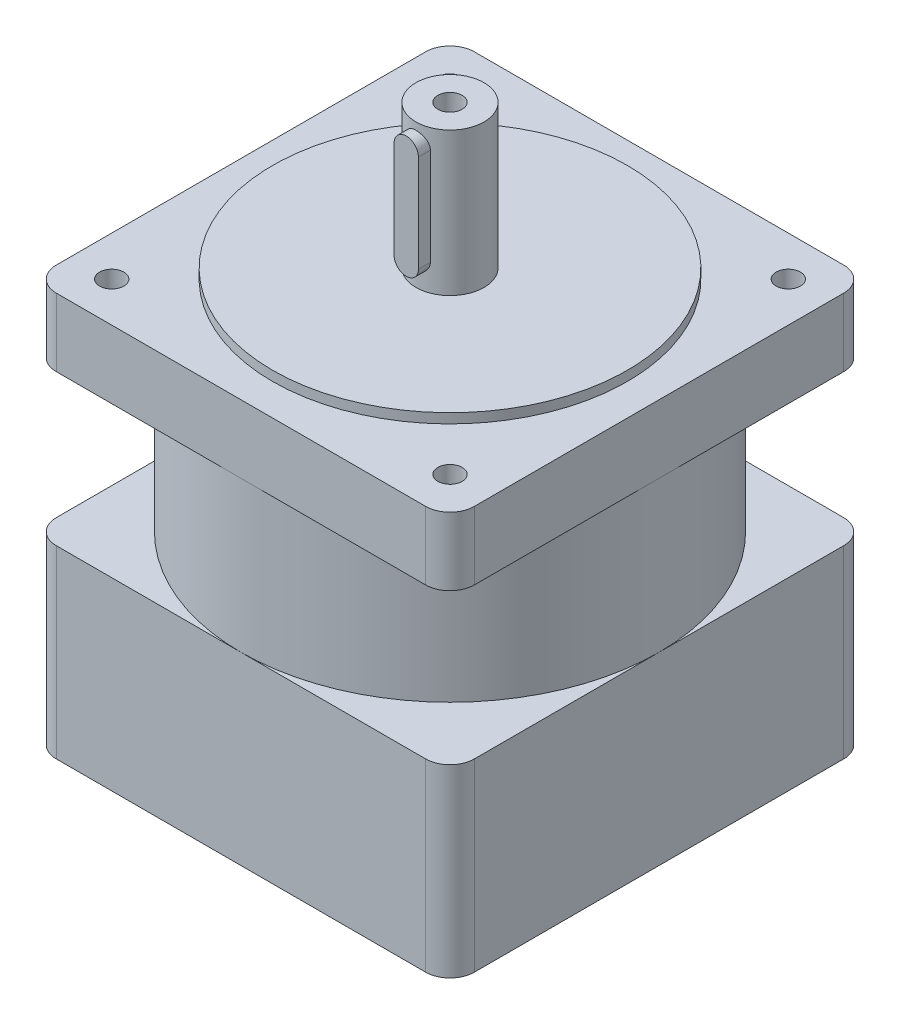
ISO-10303-21;
HEADER;
FILE_DESCRIPTION(('STEP AP214'),'2;1');
FILE_NAME('part.step','',(''),(''),'','','');
FILE_SCHEMA(('AUTOMOTIVE_DESIGN { 1 0 10303 214 1 1 1 1 }'));
ENDSEC;
DATA;
#1=APPLICATION_CONTEXT('core data for automotive mechanical design processes');
#2=APPLICATION_PROTOCOL_DEFINITION('international standard','automotive_design',2000,#1);
#3=PRODUCT_CONTEXT('',#1,'mechanical');
#4=PRODUCT('Part','Part','',(#3));
#5=PRODUCT_RELATED_PRODUCT_CATEGORY('part','',(#4));
#6=PRODUCT_DEFINITION_FORMATION('','',#4);
#7=PRODUCT_DEFINITION_CONTEXT('part definition',#1,'design');
#8=PRODUCT_DEFINITION('design','',#6,#7);
#9=PRODUCT_DEFINITION_SHAPE('','',#8);
#10=(LENGTH_UNIT() NAMED_UNIT(*) SI_UNIT(.MILLI.,.METRE.));
#11=(NAMED_UNIT(*) PLANE_ANGLE_UNIT() SI_UNIT($,.RADIAN.));
#12=(NAMED_UNIT(*) SI_UNIT($,.STERADIAN.) SOLID_ANGLE_UNIT());
#13=UNCERTAINTY_MEASURE_WITH_UNIT(LENGTH_MEASURE(1.E-05),#10,'distance_accuracy_value','');
#14=(GEOMETRIC_REPRESENTATION_CONTEXT(3) GLOBAL_UNCERTAINTY_ASSIGNED_CONTEXT((#13)) GLOBAL_UNIT_ASSIGNED_CONTEXT((#10,
#11,#12)) REPRESENTATION_CONTEXT('',''));
#15=CARTESIAN_POINT('',(0.,0.,0.));
#16=DIRECTION('',(0.,0.,1.));
#17=DIRECTION('',(1.,0.,0.));
#18=AXIS2_PLACEMENT_3D('',#15,#16,#17);
#19=CARTESIAN_POINT('',(0.,0.,0.));
#20=DIRECTION('',(0.,1.,0.));
#21=DIRECTION('',(0.,0.,1.));
#22=AXIS2_PLACEMENT_3D('',#19,#20,#21);
#23=PLANE('',#22);
#24=CARTESIAN_POINT('',(34.8,0.,34.8));
#25=DIRECTION('',(0.,1.,0.));
#26=DIRECTION('',(0.,0.,1.));
#27=AXIS2_PLACEMENT_3D('',#24,#25,#26);
#28=CIRCLE('',#27,2.5);
#29=CARTESIAN_POINT('',(34.8,0.,37.3));
#30=VERTEX_POINT('',#29);
#31=EDGE_CURVE('E1132',#30,#30,#28,.T.);
#32=ORIENTED_EDGE('',*,*,#31,.T.);
#33=EDGE_LOOP('',(#32));
#34=FACE_BOUND('',#33,.T.);
#35=DIRECTION('',(1.,0.,0.));
#36=VECTOR('',#35,1.);
#37=CARTESIAN_POINT('',(-43.,0.,43.));
#38=LINE('',#37,#36);
#39=CARTESIAN_POINT('',(0.,0.,43.));
#40=VERTEX_POINT('',#39);
#41=CARTESIAN_POINT('',(38.,0.,43.));
#42=VERTEX_POINT('',#41);
#43=EDGE_CURVE('E397',#40,#42,#38,.T.);
#44=ORIENTED_EDGE('',*,*,#43,.F.);
#45=CARTESIAN_POINT('',(0.,0.,0.));
#46=DIRECTION('',(0.,1.,0.));
#47=DIRECTION('',(0.,0.,1.));
#48=AXIS2_PLACEMENT_3D('',#45,#46,#47);
#49=CIRCLE('',#48,43.);
#50=CARTESIAN_POINT('',(43.,0.,0.));
#51=VERTEX_POINT('',#50);
#52=EDGE_CURVE('E314',#40,#51,#49,.T.);
#53=ORIENTED_EDGE('',*,*,#52,.T.);
#54=DIRECTION('',(0.,0.,-1.));
#55=VECTOR('',#54,1.);
#56=CARTESIAN_POINT('',(43.,0.,-43.));
#57=LINE('',#56,#55);
#58=CARTESIAN_POINT('',(43.,0.,38.));
#59=VERTEX_POINT('',#58);
#60=EDGE_CURVE('E386',#59,#51,#57,.T.);
#61=ORIENTED_EDGE('',*,*,#60,.F.);
#62=CARTESIAN_POINT('',(38.,0.,38.));
#63=DIRECTION('',(0.,1.,0.));
#64=DIRECTION('',(0.,0.,1.));
#65=AXIS2_PLACEMENT_3D('',#62,#63,#64);
#66=CIRCLE('',#65,5.);
#67=EDGE_CURVE('E407',#59,#42,#66,.F.);
#68=ORIENTED_EDGE('',*,*,#67,.T.);
#69=EDGE_LOOP('',(#44,#53,#61,#68));
#70=FACE_BOUND('',#69,.T.);
#71=ADVANCED_FACE('F39',(#34,#70),#23,.F.);
#72=CARTESIAN_POINT('',(34.8,0.,-34.8));
#73=DIRECTION('',(0.,1.,0.));
#74=DIRECTION('',(0.,0.,1.));
#75=AXIS2_PLACEMENT_3D('',#72,#73,#74);
#76=CIRCLE('',#75,2.5);
#77=CARTESIAN_POINT('',(34.8,0.,-32.3));
#78=VERTEX_POINT('',#77);
#79=EDGE_CURVE('E254',#78,#78,#76,.T.);
#80=ORIENTED_EDGE('',*,*,#79,.T.);
#81=EDGE_LOOP('',(#80));
#82=FACE_BOUND('',#81,.T.);
#83=CARTESIAN_POINT('',(43.,0.,-38.));
#84=VERTEX_POINT('',#83);
#85=EDGE_CURVE('E368',#51,#84,#57,.T.);
#86=ORIENTED_EDGE('',*,*,#85,.F.);
#87=CARTESIAN_POINT('',(0.,0.,-43.));
#88=VERTEX_POINT('',#87);
#89=EDGE_CURVE('E333',#51,#88,#49,.T.);
#90=ORIENTED_EDGE('',*,*,#89,.T.);
#91=DIRECTION('',(-1.,0.,0.));
#92=VECTOR('',#91,1.);
#93=CARTESIAN_POINT('',(-43.,0.,-43.));
#94=LINE('',#93,#92);
#95=CARTESIAN_POINT('',(38.,0.,-43.));
#96=VERTEX_POINT('',#95);
#97=EDGE_CURVE('E390',#96,#88,#94,.T.);
#98=ORIENTED_EDGE('',*,*,#97,.F.);
#99=CARTESIAN_POINT('',(38.,0.,-38.));
#100=DIRECTION('',(0.,1.,0.));
#101=DIRECTION('',(0.,0.,1.));
#102=AXIS2_PLACEMENT_3D('',#99,#100,#101);
#103=CIRCLE('',#102,5.);
#104=EDGE_CURVE('E410',#96,#84,#103,.F.);
#105=ORIENTED_EDGE('',*,*,#104,.T.);
#106=EDGE_LOOP('',(#86,#90,#98,#105));
#107=FACE_BOUND('',#106,.T.);
#108=ADVANCED_FACE('F549',(#82,#107),#23,.F.);
#109=CARTESIAN_POINT('',(-34.8,0.,-34.8));
#110=DIRECTION('',(0.,1.,0.));
#111=DIRECTION('',(0.,0.,1.));
#112=AXIS2_PLACEMENT_3D('',#109,#110,#111);
#113=CIRCLE('',#112,2.5);
#114=CARTESIAN_POINT('',(-34.8,0.,-32.3));
#115=VERTEX_POINT('',#114);
#116=EDGE_CURVE('E587',#115,#115,#113,.T.);
#117=ORIENTED_EDGE('',*,*,#116,.T.);
#118=EDGE_LOOP('',(#117));
#119=FACE_BOUND('',#118,.T.);
#120=CARTESIAN_POINT('',(-38.,0.,-43.));
#121=VERTEX_POINT('',#120);
#122=EDGE_CURVE('E389',#88,#121,#94,.T.);
#123=ORIENTED_EDGE('',*,*,#122,.F.);
#124=CARTESIAN_POINT('',(-43.,0.,0.));
#125=VERTEX_POINT('',#124);
#126=EDGE_CURVE('E591',#88,#125,#49,.T.);
#127=ORIENTED_EDGE('',*,*,#126,.T.);
#128=DIRECTION('',(0.,0.,1.));
#129=VECTOR('',#128,1.);
#130=CARTESIAN_POINT('',(-43.,0.,-43.));
#131=LINE('',#130,#129);
#132=CARTESIAN_POINT('',(-43.,0.,-38.));
#133=VERTEX_POINT('',#132);
#134=EDGE_CURVE('E394',#133,#125,#131,.T.);
#135=ORIENTED_EDGE('',*,*,#134,.F.);
#136=CARTESIAN_POINT('',(-38.,0.,-38.));
#137=DIRECTION('',(0.,1.,0.));
#138=DIRECTION('',(0.,0.,1.));
#139=AXIS2_PLACEMENT_3D('',#136,#137,#138);
#140=CIRCLE('',#139,5.);
#141=EDGE_CURVE('E413',#133,#121,#140,.F.);
#142=ORIENTED_EDGE('',*,*,#141,.T.);
#143=EDGE_LOOP('',(#123,#127,#135,#142));
#144=FACE_BOUND('',#143,.T.);
#145=ADVANCED_FACE('F556',(#119,#144),#23,.F.);
#146=CARTESIAN_POINT('',(0.,45.5,0.));
#147=DIRECTION('',(0.,-1.,0.));
#148=DIRECTION('',(0.,0.,-1.));
#149=AXIS2_PLACEMENT_3D('',#146,#147,#148);
#150=CYLINDRICAL_SURFACE('',#149,7.);
#151=CARTESIAN_POINT('',(0.,45.5,0.));
#152=DIRECTION('',(0.,1.,0.));
#153=DIRECTION('',(0.,0.,1.));
#154=AXIS2_PLACEMENT_3D('',#151,#152,#153);
#155=CIRCLE('',#154,7.);
#156=CARTESIAN_POINT('',(0.,45.5,7.));
#157=VERTEX_POINT('',#156);
#158=EDGE_CURVE('E361',#157,#157,#155,.T.);
#159=ORIENTED_EDGE('',*,*,#158,.F.);
#160=EDGE_LOOP('',(#159));
#161=FACE_BOUND('',#160,.T.);
#162=CARTESIAN_POINT('',(0.,16.,0.));
#163=DIRECTION('',(0.,1.,0.));
#164=DIRECTION('',(0.,0.,1.));
#165=AXIS2_PLACEMENT_3D('',#162,#163,#164);
#166=CIRCLE('',#165,7.);
#167=CARTESIAN_POINT('',(0.,16.,7.));
#168=VERTEX_POINT('',#167);
#169=EDGE_CURVE('E364',#168,#168,#166,.F.);
#170=ORIENTED_EDGE('',*,*,#169,.F.);
#171=EDGE_LOOP('',(#170));
#172=FACE_BOUND('',#171,.T.);
#173=CARTESIAN_POINT('',(-2.5,41.5,6.53834841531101));
#174=CARTESIAN_POINT('',(-2.50000293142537,41.3644729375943,6.53834584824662));
#175=CARTESIAN_POINT('',(-2.48894249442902,41.2289661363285,6.54260813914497));
#176=CARTESIAN_POINT('',(-2.44517096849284,40.9620070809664,6.55909115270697));
#177=CARTESIAN_POINT('',(-2.41245881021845,40.8305550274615,6.57131226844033));
#178=CARTESIAN_POINT('',(-2.32671186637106,40.5756252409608,6.60215581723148));
#179=CARTESIAN_POINT('',(-2.27372177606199,40.4521306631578,6.62076416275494));
#180=CARTESIAN_POINT('',(-2.14907922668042,40.2157391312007,6.66226377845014));
#181=CARTESIAN_POINT('',(-2.0774217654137,40.1028450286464,6.68515619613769));
#182=CARTESIAN_POINT('',(-1.91402447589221,39.8857788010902,6.73379932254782));
#183=CARTESIAN_POINT('',(-1.82158324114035,39.7821521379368,6.75962863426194));
#184=CARTESIAN_POINT('',(-1.62073451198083,39.5914931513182,6.81057580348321));
#185=CARTESIAN_POINT('',(-1.51232401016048,39.504463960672,6.8356935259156));
#186=CARTESIAN_POINT('',(-1.27854087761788,39.3469109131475,6.88331097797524));
#187=CARTESIAN_POINT('',(-1.15275218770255,39.2769705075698,6.90570766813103));
#188=CARTESIAN_POINT('',(-0.890255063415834,39.1594649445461,6.94442306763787));
#189=CARTESIAN_POINT('',(-0.753550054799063,39.1118927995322,6.9607436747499));
#190=CARTESIAN_POINT('',(-0.478828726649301,39.0423590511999,6.98491061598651));
#191=CARTESIAN_POINT('',(-0.341077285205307,39.0194604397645,6.99306609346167));
#192=CARTESIAN_POINT('',(-0.0634617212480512,38.9969316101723,7.00108797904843));
#193=CARTESIAN_POINT('',(0.0764017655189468,38.9972945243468,7.0009568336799));
#194=CARTESIAN_POINT('',(0.347592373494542,39.0207111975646,6.99262260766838));
#195=CARTESIAN_POINT('',(0.479020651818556,39.0427445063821,6.98478254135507));
#196=CARTESIAN_POINT('',(0.736174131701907,39.1071728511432,6.96237851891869));
#197=CARTESIAN_POINT('',(0.861898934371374,39.1495693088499,6.94781409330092));
#198=CARTESIAN_POINT('',(1.10616096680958,39.2540469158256,6.91316507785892));
#199=CARTESIAN_POINT('',(1.22457268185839,39.3163957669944,6.89300594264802));
#200=CARTESIAN_POINT('',(1.44953519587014,39.4587791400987,6.84923357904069));
#201=CARTESIAN_POINT('',(1.55608236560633,39.5388190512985,6.82561929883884));
#202=CARTESIAN_POINT('',(1.76033248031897,39.7193307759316,6.77590353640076));
#203=CARTESIAN_POINT('',(1.85725678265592,39.8206669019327,6.74973657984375));
#204=CARTESIAN_POINT('',(2.03301110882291,40.0383434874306,6.69889962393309));
#205=CARTESIAN_POINT('',(2.11183741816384,40.1546870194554,6.67422993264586));
#206=CARTESIAN_POINT('',(2.25045901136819,40.4018776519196,6.62879124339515));
#207=CARTESIAN_POINT('',(2.30987563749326,40.5329530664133,6.6081027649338));
#208=CARTESIAN_POINT('',(2.40551106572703,40.804179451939,6.57389739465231));
#209=CARTESIAN_POINT('',(2.44174134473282,40.9443258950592,6.56037695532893));
#210=CARTESIAN_POINT('',(2.48828716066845,41.2220838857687,6.54286005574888));
#211=CARTESIAN_POINT('',(2.49982704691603,41.359461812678,6.53841416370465));
#212=CARTESIAN_POINT('',(2.50016897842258,41.6342333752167,6.53828418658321));
#213=CARTESIAN_POINT('',(2.48897597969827,41.7716270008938,6.54259819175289));
#214=CARTESIAN_POINT('',(2.44527599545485,42.0365737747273,6.55904904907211));
#215=CARTESIAN_POINT('',(2.41367185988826,42.1642987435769,6.57085417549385));
#216=CARTESIAN_POINT('',(2.33115923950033,42.4125899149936,6.60057618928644));
#217=CARTESIAN_POINT('',(2.2802470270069,42.5331547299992,6.6184942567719));
#218=CARTESIAN_POINT('',(2.15854403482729,42.7684001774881,6.65919897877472));
#219=CARTESIAN_POINT('',(2.08711845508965,42.8827259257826,6.68213439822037));
#220=CARTESIAN_POINT('',(1.92711056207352,43.098207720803,6.73002297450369));
#221=CARTESIAN_POINT('',(1.83852249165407,43.1993593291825,6.75497680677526));
#222=CARTESIAN_POINT('',(1.64077043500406,43.3915426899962,6.80579566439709));
#223=CARTESIAN_POINT('',(1.53072651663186,43.4816793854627,6.83163247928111));
#224=CARTESIAN_POINT('',(1.29643714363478,43.6422926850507,6.87993729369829));
#225=CARTESIAN_POINT('',(1.1721919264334,43.7127696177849,6.90240534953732));
#226=CARTESIAN_POINT('',(0.913380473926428,43.8315002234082,6.94137984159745));
#227=CARTESIAN_POINT('',(0.778870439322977,43.8798660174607,6.95791626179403));
#228=CARTESIAN_POINT('',(0.50290689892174,43.9530468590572,6.9832833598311));
#229=CARTESIAN_POINT('',(0.361456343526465,43.9778718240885,6.99211728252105));
#230=CARTESIAN_POINT('',(0.0837575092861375,44.0022729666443,7.0008038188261));
#231=CARTESIAN_POINT('',(-0.0523654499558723,44.0031261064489,7.00111065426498));
#232=CARTESIAN_POINT('',(-0.322726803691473,43.9827846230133,6.99386365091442));
#233=CARTESIAN_POINT('',(-0.456965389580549,43.9615922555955,6.98631061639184));
#234=CARTESIAN_POINT('',(-0.716981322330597,43.8986398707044,6.96438311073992));
#235=CARTESIAN_POINT('',(-0.842875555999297,43.8573092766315,6.95015128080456));
#236=CARTESIAN_POINT('',(-1.08597143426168,43.7556669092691,6.91633887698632));
#237=CARTESIAN_POINT('',(-1.20317144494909,43.6953515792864,6.8967573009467));
#238=CARTESIAN_POINT('',(-1.43068233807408,43.5546886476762,6.85325490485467));
#239=CARTESIAN_POINT('',(-1.54052934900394,43.4736355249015,6.82919171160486));
#240=CARTESIAN_POINT('',(-1.74546847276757,43.2949475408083,6.77971046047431));
#241=CARTESIAN_POINT('',(-1.84055552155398,43.1973070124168,6.75429194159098));
#242=CARTESIAN_POINT('',(-2.01782220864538,42.9827811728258,6.70352883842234));
#243=CARTESIAN_POINT('',(-2.09919180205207,42.8652101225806,6.67824313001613));
#244=CARTESIAN_POINT('',(-2.24100798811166,42.6172615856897,6.63200351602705));
#245=CARTESIAN_POINT('',(-2.30145599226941,42.4868849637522,6.61104931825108));
#246=CARTESIAN_POINT('',(-2.39953333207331,42.2162590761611,6.57609213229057));
#247=CARTESIAN_POINT('',(-2.43706721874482,42.0759711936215,6.56211826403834));
#248=CARTESIAN_POINT('',(-2.48729274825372,41.7904461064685,6.54325005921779));
#249=CARTESIAN_POINT('',(-2.4999968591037,41.6452114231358,6.53835116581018));
#250=CARTESIAN_POINT('',(-2.5,41.5,6.53834841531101));
#251=B_SPLINE_CURVE_WITH_KNOTS('',3,(#173,#174,#175,#176,#177,#178,#179,#180,#181,#182,#183,
#184,#185,#186,#187,#188,#189,#190,#191,#192,#193,#194,#195,#196,#197,#198,#199,#200,#201,#202,
#203,#204,#205,#206,#207,#208,#209,#210,#211,#212,#213,#214,#215,#216,#217,#218,#219,#220,#221,
#222,#223,#224,#225,#226,#227,#228,#229,#230,#231,#232,#233,#234,#235,#236,#237,#238,#239,#240,
#241,#242,#243,#244,#245,#246,#247,#248,#249,#250),.UNSPECIFIED.,.T.,.F.,(4,2,2,2,2,2,2,2,2,2,2,
2,2,2,2,2,2,2,2,2,2,2,2,2,2,2,2,2,2,2,2,2,2,2,2,2,2,2,4),(0.,0.406041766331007,
0.812103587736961,1.21727550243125,1.62255610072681,2.04441002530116,2.46634349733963,
2.90112813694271,3.33577686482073,3.75326460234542,4.17062908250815,4.56923737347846,
4.96787349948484,5.37209971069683,5.77644923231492,6.20244167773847,6.62852147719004,
7.06247609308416,7.4962157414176,7.90789453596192,8.31948358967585,8.71400941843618,
9.10861145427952,9.51705885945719,9.92564351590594,10.3573204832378,10.7889902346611,
11.2184461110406,11.6477209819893,12.0540827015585,12.4604028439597,12.8584146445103,
13.2565010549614,13.67053016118,14.0847010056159,14.5182116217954,14.9516929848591,
15.386967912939,15.8220242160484),.UNSPECIFIED.);
#252=CARTESIAN_POINT('',(2.5,41.5,6.53834841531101));
#253=VERTEX_POINT('',#252);
#254=CARTESIAN_POINT('',(-2.5,41.5,6.53834841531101));
#255=VERTEX_POINT('',#254);
#256=EDGE_CURVE('E474',#253,#255,#251,.T.);
#257=ORIENTED_EDGE('',*,*,#256,.F.);
#258=DIRECTION('',(0.,-1.,0.));
#259=VECTOR('',#258,1.);
#260=CARTESIAN_POINT('',(2.5,45.5,6.53834841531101));
#261=LINE('',#260,#259);
#262=CARTESIAN_POINT('',(2.5,21.5,6.53834841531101));
#263=VERTEX_POINT('',#262);
#264=EDGE_CURVE('E439',#263,#253,#261,.F.);
#265=ORIENTED_EDGE('',*,*,#264,.F.);
#266=CARTESIAN_POINT('',(-2.5,21.5,6.53834841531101));
#267=CARTESIAN_POINT('',(-2.50000293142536,21.3644729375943,6.53834584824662));
#268=CARTESIAN_POINT('',(-2.48894249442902,21.2289661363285,6.54260813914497));
#269=CARTESIAN_POINT('',(-2.44517096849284,20.9620070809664,6.55909115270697));
#270=CARTESIAN_POINT('',(-2.41245881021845,20.8305550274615,6.57131226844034));
#271=CARTESIAN_POINT('',(-2.32671186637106,20.5756252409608,6.60215581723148));
#272=CARTESIAN_POINT('',(-2.27372177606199,20.4521306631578,6.62076416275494));
#273=CARTESIAN_POINT('',(-2.14907922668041,20.2157391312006,6.66226377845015));
#274=CARTESIAN_POINT('',(-2.0774217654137,20.1028450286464,6.68515619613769));
#275=CARTESIAN_POINT('',(-1.91402447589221,19.8857788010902,6.73379932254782));
#276=CARTESIAN_POINT('',(-1.82158324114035,19.7821521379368,6.75962863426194));
#277=CARTESIAN_POINT('',(-1.62073451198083,19.5914931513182,6.81057580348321));
#278=CARTESIAN_POINT('',(-1.51232401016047,19.504463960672,6.8356935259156));
#279=CARTESIAN_POINT('',(-1.27854087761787,19.3469109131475,6.88331097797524));
#280=CARTESIAN_POINT('',(-1.15275218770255,19.2769705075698,6.90570766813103));
#281=CARTESIAN_POINT('',(-0.890255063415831,19.1594649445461,6.94442306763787));
#282=CARTESIAN_POINT('',(-0.753550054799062,19.1118927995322,6.9607436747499));
#283=CARTESIAN_POINT('',(-0.478828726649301,19.0423590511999,6.98491061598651));
#284=CARTESIAN_POINT('',(-0.341077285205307,19.0194604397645,6.99306609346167));
#285=CARTESIAN_POINT('',(-0.0634617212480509,18.9969316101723,7.00108797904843));
#286=CARTESIAN_POINT('',(0.0764017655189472,18.9972945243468,7.0009568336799));
#287=CARTESIAN_POINT('',(0.347592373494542,19.0207111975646,6.99262260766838));
#288=CARTESIAN_POINT('',(0.479020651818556,19.0427445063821,6.98478254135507));
#289=CARTESIAN_POINT('',(0.736174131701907,19.1071728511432,6.96237851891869));
#290=CARTESIAN_POINT('',(0.861898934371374,19.1495693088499,6.94781409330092));
#291=CARTESIAN_POINT('',(1.10616096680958,19.2540469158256,6.91316507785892));
#292=CARTESIAN_POINT('',(1.22457268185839,19.3163957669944,6.89300594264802));
#293=CARTESIAN_POINT('',(1.44953519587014,19.4587791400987,6.84923357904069));
#294=CARTESIAN_POINT('',(1.55608236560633,19.5388190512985,6.82561929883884));
#295=CARTESIAN_POINT('',(1.76033248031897,19.7193307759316,6.77590353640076));
#296=CARTESIAN_POINT('',(1.85725678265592,19.8206669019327,6.74973657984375));
#297=CARTESIAN_POINT('',(2.03301110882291,20.0383434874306,6.69889962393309));
#298=CARTESIAN_POINT('',(2.11183741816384,20.1546870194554,6.67422993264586));
#299=CARTESIAN_POINT('',(2.25045901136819,20.4018776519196,6.62879124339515));
#300=CARTESIAN_POINT('',(2.30987563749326,20.5329530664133,6.6081027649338));
#301=CARTESIAN_POINT('',(2.40551106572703,20.804179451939,6.57389739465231));
#302=CARTESIAN_POINT('',(2.44174134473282,20.9443258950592,6.56037695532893));
#303=CARTESIAN_POINT('',(2.48828716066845,21.2220838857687,6.54286005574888));
#304=CARTESIAN_POINT('',(2.49982704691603,21.359461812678,6.53841416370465));
#305=CARTESIAN_POINT('',(2.50016897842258,21.6342333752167,6.53828418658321));
#306=CARTESIAN_POINT('',(2.48897597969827,21.7716270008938,6.54259819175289));
#307=CARTESIAN_POINT('',(2.44527599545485,22.0365737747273,6.55904904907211));
#308=CARTESIAN_POINT('',(2.41367185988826,22.1642987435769,6.57085417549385));
#309=CARTESIAN_POINT('',(2.33115923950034,22.4125899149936,6.60057618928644));
#310=CARTESIAN_POINT('',(2.2802470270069,22.5331547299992,6.6184942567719));
#311=CARTESIAN_POINT('',(2.15854403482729,22.7684001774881,6.65919897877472));
#312=CARTESIAN_POINT('',(2.08711845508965,22.8827259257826,6.68213439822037));
#313=CARTESIAN_POINT('',(1.92711056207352,23.098207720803,6.73002297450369));
#314=CARTESIAN_POINT('',(1.83852249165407,23.1993593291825,6.75497680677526));
#315=CARTESIAN_POINT('',(1.64077043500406,23.3915426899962,6.80579566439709));
#316=CARTESIAN_POINT('',(1.53072651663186,23.4816793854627,6.83163247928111));
#317=CARTESIAN_POINT('',(1.29643714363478,23.6422926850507,6.87993729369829));
#318=CARTESIAN_POINT('',(1.17219192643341,23.7127696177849,6.90240534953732));
#319=CARTESIAN_POINT('',(0.91338047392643,23.8315002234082,6.94137984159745));
#320=CARTESIAN_POINT('',(0.778870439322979,23.8798660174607,6.95791626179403));
#321=CARTESIAN_POINT('',(0.502906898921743,23.9530468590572,6.9832833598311));
#322=CARTESIAN_POINT('',(0.361456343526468,23.9778718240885,6.99211728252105));
#323=CARTESIAN_POINT('',(0.0837575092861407,24.0022729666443,7.0008038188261));
#324=CARTESIAN_POINT('',(-0.0523654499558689,24.0031261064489,7.00111065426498));
#325=CARTESIAN_POINT('',(-0.322726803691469,23.9827846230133,6.99386365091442));
#326=CARTESIAN_POINT('',(-0.456965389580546,23.9615922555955,6.98631061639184));
#327=CARTESIAN_POINT('',(-0.716981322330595,23.8986398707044,6.96438311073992));
#328=CARTESIAN_POINT('',(-0.842875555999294,23.8573092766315,6.95015128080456));
#329=CARTESIAN_POINT('',(-1.08597143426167,23.7556669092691,6.91633887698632));
#330=CARTESIAN_POINT('',(-1.20317144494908,23.6953515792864,6.8967573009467));
#331=CARTESIAN_POINT('',(-1.43068233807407,23.5546886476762,6.85325490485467));
#332=CARTESIAN_POINT('',(-1.54052934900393,23.4736355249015,6.82919171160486));
#333=CARTESIAN_POINT('',(-1.74546847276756,23.2949475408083,6.77971046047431));
#334=CARTESIAN_POINT('',(-1.84055552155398,23.1973070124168,6.75429194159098));
#335=CARTESIAN_POINT('',(-2.01782220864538,22.9827811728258,6.70352883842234));
#336=CARTESIAN_POINT('',(-2.09919180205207,22.8652101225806,6.67824313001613));
#337=CARTESIAN_POINT('',(-2.24100798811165,22.6172615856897,6.63200351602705));
#338=CARTESIAN_POINT('',(-2.30145599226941,22.4868849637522,6.61104931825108));
#339=CARTESIAN_POINT('',(-2.39953333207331,22.2162590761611,6.57609213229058));
#340=CARTESIAN_POINT('',(-2.43706721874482,22.0759711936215,6.56211826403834));
#341=CARTESIAN_POINT('',(-2.48729274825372,21.7904461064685,6.54325005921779));
#342=CARTESIAN_POINT('',(-2.49999685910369,21.6452114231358,6.53835116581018));
#343=CARTESIAN_POINT('',(-2.5,21.5,6.53834841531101));
#344=B_SPLINE_CURVE_WITH_KNOTS('',3,(#266,#267,#268,#269,#270,#271,#272,#273,#274,#275,#276,
#277,#278,#279,#280,#281,#282,#283,#284,#285,#286,#287,#288,#289,#290,#291,#292,#293,#294,#295,
#296,#297,#298,#299,#300,#301,#302,#303,#304,#305,#306,#307,#308,#309,#310,#311,#312,#313,#314,
#315,#316,#317,#318,#319,#320,#321,#322,#323,#324,#325,#326,#327,#328,#329,#330,#331,#332,#333,
#334,#335,#336,#337,#338,#339,#340,#341,#342,#343),.UNSPECIFIED.,.T.,.F.,(4,2,2,2,2,2,2,2,2,2,2,
2,2,2,2,2,2,2,2,2,2,2,2,2,2,2,2,2,2,2,2,2,2,2,2,2,2,2,4),(0.,0.406041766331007,
0.812103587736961,1.21727550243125,1.62255610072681,2.04441002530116,2.46634349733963,
2.90112813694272,3.33577686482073,3.75326460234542,4.17062908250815,4.56923737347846,
4.96787349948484,5.37209971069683,5.77644923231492,6.20244167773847,6.62852147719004,
7.06247609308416,7.49621574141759,7.90789453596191,8.31948358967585,8.71400941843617,
9.10861145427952,9.51705885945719,9.92564351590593,10.3573204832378,10.7889902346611,
11.2184461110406,11.6477209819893,12.0540827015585,12.4604028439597,12.8584146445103,
13.2565010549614,13.67053016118,14.0847010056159,14.5182116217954,14.9516929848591,
15.386967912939,15.8220242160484),.UNSPECIFIED.);
#345=CARTESIAN_POINT('',(-2.5,21.5,6.53834841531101));
#346=VERTEX_POINT('',#345);
#347=EDGE_CURVE('E444',#346,#263,#344,.T.);
#348=ORIENTED_EDGE('',*,*,#347,.F.);
#349=DIRECTION('',(0.,-1.,0.));
#350=VECTOR('',#349,1.);
#351=CARTESIAN_POINT('',(-2.5,45.5,6.53834841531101));
#352=LINE('',#351,#350);
#353=EDGE_CURVE('E451',#255,#346,#352,.T.);
#354=ORIENTED_EDGE('',*,*,#353,.F.);
#355=EDGE_LOOP('',(#257,#265,#348,#354));
#356=FACE_BOUND('',#355,.T.);
#357=ADVANCED_FACE('F453',(#161,#172,#356),#150,.T.);
#358=CARTESIAN_POINT('',(0.,16.,0.));
#359=DIRECTION('',(0.,1.,0.));
#360=DIRECTION('',(0.,0.,1.));
#361=AXIS2_PLACEMENT_3D('',#358,#359,#360);
#362=PLANE('',#361);
#363=CARTESIAN_POINT('',(0.,16.,0.));
#364=DIRECTION('',(0.,1.,0.));
#365=DIRECTION('',(0.,0.,1.));
#366=AXIS2_PLACEMENT_3D('',#363,#364,#365);
#367=CIRCLE('',#366,36.5);
#368=CARTESIAN_POINT('',(0.,16.,36.5));
#369=VERTEX_POINT('',#368);
#370=EDGE_CURVE('E365',#369,#369,#367,.T.);
#371=ORIENTED_EDGE('',*,*,#370,.T.);
#372=EDGE_LOOP('',(#371));
#373=FACE_BOUND('',#372,.T.);
#374=ORIENTED_EDGE('',*,*,#169,.T.);
#375=EDGE_LOOP('',(#374));
#376=FACE_BOUND('',#375,.T.);
#377=ADVANCED_FACE('F582',(#373,#376),#362,.T.);
#378=CARTESIAN_POINT('',(0.,14.,0.));
#379=DIRECTION('',(0.,1.,0.));
#380=DIRECTION('',(0.,0.,1.));
#381=AXIS2_PLACEMENT_3D('',#378,#379,#380);
#382=PLANE('',#381);
#383=CARTESIAN_POINT('',(-34.8,14.,-34.8));
#384=DIRECTION('',(0.,1.,0.));
#385=DIRECTION('',(0.,0.,1.));
#386=AXIS2_PLACEMENT_3D('',#383,#384,#385);
#387=CIRCLE('',#386,2.5);
#388=CARTESIAN_POINT('',(-34.8,14.,-32.3));
#389=VERTEX_POINT('',#388);
#390=EDGE_CURVE('E1119',#389,#389,#387,.T.);
#391=ORIENTED_EDGE('',*,*,#390,.F.);
#392=EDGE_LOOP('',(#391));
#393=FACE_BOUND('',#392,.T.);
#394=CARTESIAN_POINT('',(-34.8,14.,34.8));
#395=DIRECTION('',(0.,1.,0.));
#396=DIRECTION('',(0.,0.,1.));
#397=AXIS2_PLACEMENT_3D('',#394,#395,#396);
#398=CIRCLE('',#397,2.5);
#399=CARTESIAN_POINT('',(-34.8,14.,37.3));
#400=VERTEX_POINT('',#399);
#401=EDGE_CURVE('E1123',#400,#400,#398,.T.);
#402=ORIENTED_EDGE('',*,*,#401,.F.);
#403=EDGE_LOOP('',(#402));
#404=FACE_BOUND('',#403,.T.);
#405=CARTESIAN_POINT('',(34.8,14.,34.8));
#406=DIRECTION('',(0.,1.,0.));
#407=DIRECTION('',(0.,0.,1.));
#408=AXIS2_PLACEMENT_3D('',#405,#406,#407);
#409=CIRCLE('',#408,2.5);
#410=CARTESIAN_POINT('',(34.8,14.,37.3));
#411=VERTEX_POINT('',#410);
#412=EDGE_CURVE('E1127',#411,#411,#409,.T.);
#413=ORIENTED_EDGE('',*,*,#412,.F.);
#414=EDGE_LOOP('',(#413));
#415=FACE_BOUND('',#414,.T.);
#416=CARTESIAN_POINT('',(34.8,14.,-34.8));
#417=DIRECTION('',(0.,1.,0.));
#418=DIRECTION('',(0.,0.,1.));
#419=AXIS2_PLACEMENT_3D('',#416,#417,#418);
#420=CIRCLE('',#419,2.5);
#421=CARTESIAN_POINT('',(34.8,14.,-32.3));
#422=VERTEX_POINT('',#421);
#423=EDGE_CURVE('E1130',#422,#422,#420,.T.);
#424=ORIENTED_EDGE('',*,*,#423,.F.);
#425=EDGE_LOOP('',(#424));
#426=FACE_BOUND('',#425,.T.);
#427=DIRECTION('',(-1.,0.,0.));
#428=VECTOR('',#427,1.);
#429=CARTESIAN_POINT('',(-43.,14.,-43.));
#430=LINE('',#429,#428);
#431=CARTESIAN_POINT('',(38.,14.,-43.));
#432=VERTEX_POINT('',#431);
#433=CARTESIAN_POINT('',(-38.,14.,-43.));
#434=VERTEX_POINT('',#433);
#435=EDGE_CURVE('E375',#432,#434,#430,.T.);
#436=ORIENTED_EDGE('',*,*,#435,.T.);
#437=CARTESIAN_POINT('',(-38.,14.,-38.));
#438=DIRECTION('',(0.,1.,0.));
#439=DIRECTION('',(0.,0.,1.));
#440=AXIS2_PLACEMENT_3D('',#437,#438,#439);
#441=CIRCLE('',#440,5.);
#442=CARTESIAN_POINT('',(-43.,14.,-38.));
#443=VERTEX_POINT('',#442);
#444=EDGE_CURVE('E427',#434,#443,#441,.T.);
#445=ORIENTED_EDGE('',*,*,#444,.T.);
#446=DIRECTION('',(0.,0.,1.));
#447=VECTOR('',#446,1.);
#448=CARTESIAN_POINT('',(-43.,14.,-43.));
#449=LINE('',#448,#447);
#450=CARTESIAN_POINT('',(-43.,14.,38.));
#451=VERTEX_POINT('',#450);
#452=EDGE_CURVE('E379',#443,#451,#449,.T.);
#453=ORIENTED_EDGE('',*,*,#452,.T.);
#454=CARTESIAN_POINT('',(-38.,14.,38.));
#455=DIRECTION('',(0.,1.,0.));
#456=DIRECTION('',(0.,0.,1.));
#457=AXIS2_PLACEMENT_3D('',#454,#455,#456);
#458=CIRCLE('',#457,5.);
#459=CARTESIAN_POINT('',(-38.,14.,43.));
#460=VERTEX_POINT('',#459);
#461=EDGE_CURVE('E421',#451,#460,#458,.T.);
#462=ORIENTED_EDGE('',*,*,#461,.T.);
#463=DIRECTION('',(1.,0.,0.));
#464=VECTOR('',#463,1.);
#465=CARTESIAN_POINT('',(-43.,14.,43.));
#466=LINE('',#465,#464);
#467=CARTESIAN_POINT('',(38.,14.,43.));
#468=VERTEX_POINT('',#467);
#469=EDGE_CURVE('E382',#460,#468,#466,.T.);
#470=ORIENTED_EDGE('',*,*,#469,.T.);
#471=CARTESIAN_POINT('',(38.,14.,38.));
#472=DIRECTION('',(0.,1.,0.));
#473=DIRECTION('',(0.,0.,1.));
#474=AXIS2_PLACEMENT_3D('',#471,#472,#473);
#475=CIRCLE('',#474,5.);
#476=CARTESIAN_POINT('',(43.,14.,38.));
#477=VERTEX_POINT('',#476);
#478=EDGE_CURVE('E423',#468,#477,#475,.T.);
#479=ORIENTED_EDGE('',*,*,#478,.T.);
#480=DIRECTION('',(0.,0.,-1.));
#481=VECTOR('',#480,1.);
#482=CARTESIAN_POINT('',(43.,14.,-43.));
#483=LINE('',#482,#481);
#484=CARTESIAN_POINT('',(43.,14.,-38.));
#485=VERTEX_POINT('',#484);
#486=EDGE_CURVE('E372',#477,#485,#483,.T.);
#487=ORIENTED_EDGE('',*,*,#486,.T.);
#488=CARTESIAN_POINT('',(38.,14.,-38.));
#489=DIRECTION('',(0.,1.,0.));
#490=DIRECTION('',(0.,0.,1.));
#491=AXIS2_PLACEMENT_3D('',#488,#489,#490);
#492=CIRCLE('',#491,5.);
#493=EDGE_CURVE('E425',#485,#432,#492,.T.);
#494=ORIENTED_EDGE('',*,*,#493,.T.);
#495=EDGE_LOOP('',(#436,#445,#453,#462,#470,#479,#487,#494));
#496=FACE_BOUND('',#495,.T.);
#497=CARTESIAN_POINT('',(0.,14.,0.));
#498=DIRECTION('',(0.,1.,0.));
#499=DIRECTION('',(0.,0.,1.));
#500=AXIS2_PLACEMENT_3D('',#497,#498,#499);
#501=CIRCLE('',#500,36.5);
#502=CARTESIAN_POINT('',(0.,14.,36.5));
#503=VERTEX_POINT('',#502);
#504=EDGE_CURVE('E369',#503,#503,#501,.T.);
#505=ORIENTED_EDGE('',*,*,#504,.F.);
#506=EDGE_LOOP('',(#505));
#507=FACE_BOUND('',#506,.T.);
#508=ADVANCED_FACE('F619',(#393,#404,#415,#426,#496,#507),#382,.T.);
#509=CARTESIAN_POINT('',(43.,14.,-43.));
#510=DIRECTION('',(-1.,0.,0.));
#511=DIRECTION('',(0.,0.,1.));
#512=AXIS2_PLACEMENT_3D('',#509,#510,#511);
#513=PLANE('',#512);
#514=ORIENTED_EDGE('',*,*,#60,.T.);
#515=ORIENTED_EDGE('',*,*,#85,.T.);
#516=DIRECTION('',(0.,-1.,0.));
#517=VECTOR('',#516,1.);
#518=CARTESIAN_POINT('',(43.,14.,-38.));
#519=LINE('',#518,#517);
#520=EDGE_CURVE('E432',#84,#485,#519,.F.);
#521=ORIENTED_EDGE('',*,*,#520,.T.);
#522=ORIENTED_EDGE('',*,*,#486,.F.);
#523=DIRECTION('',(0.,-1.,0.));
#524=VECTOR('',#523,1.);
#525=CARTESIAN_POINT('',(43.,14.,38.));
#526=LINE('',#525,#524);
#527=EDGE_CURVE('E429',#477,#59,#526,.T.);
#528=ORIENTED_EDGE('',*,*,#527,.T.);
#529=EDGE_LOOP('',(#514,#515,#521,#522,#528));
#530=FACE_BOUND('',#529,.T.);
#531=ADVANCED_FACE('F626',(#530),#513,.F.);
#532=CARTESIAN_POINT('',(-43.,14.,-43.));
#533=DIRECTION('',(0.,0.,1.));
#534=DIRECTION('',(1.,0.,0.));
#535=AXIS2_PLACEMENT_3D('',#532,#533,#534);
#536=PLANE('',#535);
#537=ORIENTED_EDGE('',*,*,#97,.T.);
#538=ORIENTED_EDGE('',*,*,#122,.T.);
#539=DIRECTION('',(0.,-1.,0.));
#540=VECTOR('',#539,1.);
#541=CARTESIAN_POINT('',(-38.,14.,-43.));
#542=LINE('',#541,#540);
#543=EDGE_CURVE('E419',#121,#434,#542,.F.);
#544=ORIENTED_EDGE('',*,*,#543,.T.);
#545=ORIENTED_EDGE('',*,*,#435,.F.);
#546=DIRECTION('',(0.,-1.,0.));
#547=VECTOR('',#546,1.);
#548=CARTESIAN_POINT('',(38.,14.,-43.));
#549=LINE('',#548,#547);
#550=EDGE_CURVE('E416',#432,#96,#549,.T.);
#551=ORIENTED_EDGE('',*,*,#550,.T.);
#552=EDGE_LOOP('',(#537,#538,#544,#545,#551));
#553=FACE_BOUND('',#552,.T.);
#554=ADVANCED_FACE('F596',(#553),#536,.F.);
#555=CARTESIAN_POINT('',(-43.,14.,-43.));
#556=DIRECTION('',(1.,0.,0.));
#557=DIRECTION('',(0.,0.,-1.));
#558=AXIS2_PLACEMENT_3D('',#555,#556,#557);
#559=PLANE('',#558);
#560=ORIENTED_EDGE('',*,*,#452,.F.);
#561=DIRECTION('',(0.,-1.,0.));
#562=VECTOR('',#561,1.);
#563=CARTESIAN_POINT('',(-43.,14.,-38.));
#564=LINE('',#563,#562);
#565=EDGE_CURVE('E401',#443,#133,#564,.T.);
#566=ORIENTED_EDGE('',*,*,#565,.T.);
#567=ORIENTED_EDGE('',*,*,#134,.T.);
#568=CARTESIAN_POINT('',(-43.,0.,38.));
#569=VERTEX_POINT('',#568);
#570=EDGE_CURVE('E393',#125,#569,#131,.T.);
#571=ORIENTED_EDGE('',*,*,#570,.T.);
#572=DIRECTION('',(0.,-1.,0.));
#573=VECTOR('',#572,1.);
#574=CARTESIAN_POINT('',(-43.,14.,38.));
#575=LINE('',#574,#573);
#576=EDGE_CURVE('E385',#569,#451,#575,.F.);
#577=ORIENTED_EDGE('',*,*,#576,.T.);
#578=EDGE_LOOP('',(#560,#566,#567,#571,#577));
#579=FACE_BOUND('',#578,.T.);
#580=ADVANCED_FACE('F573',(#579),#559,.F.);
#581=CARTESIAN_POINT('',(-43.,14.,43.));
#582=DIRECTION('',(0.,0.,-1.));
#583=DIRECTION('',(-1.,0.,0.));
#584=AXIS2_PLACEMENT_3D('',#581,#582,#583);
#585=PLANE('',#584);
#586=CARTESIAN_POINT('',(-38.,0.,43.));
#587=VERTEX_POINT('',#586);
#588=EDGE_CURVE('E376',#587,#40,#38,.T.);
#589=ORIENTED_EDGE('',*,*,#588,.T.);
#590=ORIENTED_EDGE('',*,*,#43,.T.);
#591=DIRECTION('',(0.,-1.,0.));
#592=VECTOR('',#591,1.);
#593=CARTESIAN_POINT('',(38.,14.,43.));
#594=LINE('',#593,#592);
#595=EDGE_CURVE('E437',#42,#468,#594,.F.);
#596=ORIENTED_EDGE('',*,*,#595,.T.);
#597=ORIENTED_EDGE('',*,*,#469,.F.);
#598=DIRECTION('',(0.,-1.,0.));
#599=VECTOR('',#598,1.);
#600=CARTESIAN_POINT('',(-38.,14.,43.));
#601=LINE('',#600,#599);
#602=EDGE_CURVE('E434',#460,#587,#601,.T.);
#603=ORIENTED_EDGE('',*,*,#602,.T.);
#604=EDGE_LOOP('',(#589,#590,#596,#597,#603));
#605=FACE_BOUND('',#604,.T.);
#606=ADVANCED_FACE('F564',(#605),#585,.F.);
#607=CARTESIAN_POINT('',(-34.8,0.,34.8));
#608=DIRECTION('',(0.,1.,0.));
#609=DIRECTION('',(0.,0.,1.));
#610=AXIS2_PLACEMENT_3D('',#607,#608,#609);
#611=CIRCLE('',#610,2.5);
#612=CARTESIAN_POINT('',(-34.8,0.,37.3));
#613=VERTEX_POINT('',#612);
#614=EDGE_CURVE('E1138',#613,#613,#611,.T.);
#615=ORIENTED_EDGE('',*,*,#614,.T.);
#616=EDGE_LOOP('',(#615));
#617=FACE_BOUND('',#616,.T.);
#618=ORIENTED_EDGE('',*,*,#570,.F.);
#619=EDGE_CURVE('E334',#125,#40,#49,.T.);
#620=ORIENTED_EDGE('',*,*,#619,.T.);
#621=ORIENTED_EDGE('',*,*,#588,.F.);
#622=CARTESIAN_POINT('',(-38.,0.,38.));
#623=DIRECTION('',(0.,1.,0.));
#624=DIRECTION('',(0.,0.,1.));
#625=AXIS2_PLACEMENT_3D('',#622,#623,#624);
#626=CIRCLE('',#625,5.);
#627=EDGE_CURVE('E404',#587,#569,#626,.F.);
#628=ORIENTED_EDGE('',*,*,#627,.T.);
#629=EDGE_LOOP('',(#618,#620,#621,#628));
#630=FACE_BOUND('',#629,.T.);
#631=ADVANCED_FACE('F552',(#617,#630),#23,.F.);
#632=CARTESIAN_POINT('',(-38.,14.,-38.));
#633=DIRECTION('',(0.,-1.,0.));
#634=DIRECTION('',(0.,0.,-1.));
#635=AXIS2_PLACEMENT_3D('',#632,#633,#634);
#636=CYLINDRICAL_SURFACE('',#635,5.);
#637=ORIENTED_EDGE('',*,*,#444,.F.);
#638=ORIENTED_EDGE('',*,*,#543,.F.);
#639=ORIENTED_EDGE('',*,*,#141,.F.);
#640=ORIENTED_EDGE('',*,*,#565,.F.);
#641=EDGE_LOOP('',(#637,#638,#639,#640));
#642=FACE_BOUND('',#641,.T.);
#643=ADVANCED_FACE('F563',(#642),#636,.T.);
#644=CARTESIAN_POINT('',(38.,14.,-38.));
#645=DIRECTION('',(0.,-1.,0.));
#646=DIRECTION('',(0.,0.,-1.));
#647=AXIS2_PLACEMENT_3D('',#644,#645,#646);
#648=CYLINDRICAL_SURFACE('',#647,5.);
#649=ORIENTED_EDGE('',*,*,#493,.F.);
#650=ORIENTED_EDGE('',*,*,#520,.F.);
#651=ORIENTED_EDGE('',*,*,#104,.F.);
#652=ORIENTED_EDGE('',*,*,#550,.F.);
#653=EDGE_LOOP('',(#649,#650,#651,#652));
#654=FACE_BOUND('',#653,.T.);
#655=ADVANCED_FACE('F570',(#654),#648,.T.);
#656=CARTESIAN_POINT('',(38.,14.,38.));
#657=DIRECTION('',(0.,-1.,0.));
#658=DIRECTION('',(0.,0.,-1.));
#659=AXIS2_PLACEMENT_3D('',#656,#657,#658);
#660=CYLINDRICAL_SURFACE('',#659,5.);
#661=ORIENTED_EDGE('',*,*,#478,.F.);
#662=ORIENTED_EDGE('',*,*,#595,.F.);
#663=ORIENTED_EDGE('',*,*,#67,.F.);
#664=ORIENTED_EDGE('',*,*,#527,.F.);
#665=EDGE_LOOP('',(#661,#662,#663,#664));
#666=FACE_BOUND('',#665,.T.);
#667=ADVANCED_FACE('F630',(#666),#660,.T.);
#668=CARTESIAN_POINT('',(-38.,14.,38.));
#669=DIRECTION('',(0.,-1.,0.));
#670=DIRECTION('',(0.,0.,-1.));
#671=AXIS2_PLACEMENT_3D('',#668,#669,#670);
#672=CYLINDRICAL_SURFACE('',#671,5.);
#673=ORIENTED_EDGE('',*,*,#461,.F.);
#674=ORIENTED_EDGE('',*,*,#576,.F.);
#675=ORIENTED_EDGE('',*,*,#627,.F.);
#676=ORIENTED_EDGE('',*,*,#602,.F.);
#677=EDGE_LOOP('',(#673,#674,#675,#676));
#678=FACE_BOUND('',#677,.T.);
#679=ADVANCED_FACE('F613',(#678),#672,.T.);
#680=CARTESIAN_POINT('',(0.,16.,0.));
#681=DIRECTION('',(0.,-1.,0.));
#682=DIRECTION('',(0.,0.,-1.));
#683=AXIS2_PLACEMENT_3D('',#680,#681,#682);
#684=CYLINDRICAL_SURFACE('',#683,36.5);
#685=ORIENTED_EDGE('',*,*,#370,.F.);
#686=EDGE_LOOP('',(#685));
#687=FACE_BOUND('',#686,.T.);
#688=ORIENTED_EDGE('',*,*,#504,.T.);
#689=EDGE_LOOP('',(#688));
#690=FACE_BOUND('',#689,.T.);
#691=ADVANCED_FACE('F637',(#687,#690),#684,.T.);
#692=CARTESIAN_POINT('',(0.,45.5,0.));
#693=DIRECTION('',(0.,1.,0.));
#694=DIRECTION('',(0.,0.,1.));
#695=AXIS2_PLACEMENT_3D('',#692,#693,#694);
#696=PLANE('',#695);
#697=CARTESIAN_POINT('',(0.,45.5,0.));
#698=DIRECTION('',(0.,1.,0.));
#699=DIRECTION('',(0.,0.,1.));
#700=AXIS2_PLACEMENT_3D('',#697,#698,#699);
#701=CIRCLE('',#700,2.5);
#702=CARTESIAN_POINT('',(0.,45.5,2.5));
#703=VERTEX_POINT('',#702);
#704=EDGE_CURVE('E328',#703,#703,#701,.T.);
#705=ORIENTED_EDGE('',*,*,#704,.F.);
#706=EDGE_LOOP('',(#705));
#707=FACE_BOUND('',#706,.T.);
#708=ORIENTED_EDGE('',*,*,#158,.T.);
#709=EDGE_LOOP('',(#708));
#710=FACE_BOUND('',#709,.T.);
#711=ADVANCED_FACE('F472',(#707,#710),#696,.T.);
#712=CARTESIAN_POINT('',(0.,41.5,9.));
#713=DIRECTION('',(0.,0.,-1.));
#714=DIRECTION('',(-1.,0.,0.));
#715=AXIS2_PLACEMENT_3D('',#712,#713,#714);
#716=CYLINDRICAL_SURFACE('',#715,2.5);
#717=DIRECTION('',(0.,0.,-1.));
#718=VECTOR('',#717,1.);
#719=CARTESIAN_POINT('',(2.5,41.5,9.));
#720=LINE('',#719,#718);
#721=CARTESIAN_POINT('',(2.5,41.5,9.));
#722=VERTEX_POINT('',#721);
#723=EDGE_CURVE('E349',#722,#253,#720,.T.);
#724=ORIENTED_EDGE('',*,*,#723,.T.);
#725=ORIENTED_EDGE('',*,*,#256,.T.);
#726=DIRECTION('',(0.,0.,-1.));
#727=VECTOR('',#726,1.);
#728=CARTESIAN_POINT('',(-2.5,41.5,9.));
#729=LINE('',#728,#727);
#730=CARTESIAN_POINT('',(-2.5,41.5,9.));
#731=VERTEX_POINT('',#730);
#732=EDGE_CURVE('E358',#731,#255,#729,.T.);
#733=ORIENTED_EDGE('',*,*,#732,.F.);
#734=CARTESIAN_POINT('',(0.,41.5,9.));
#735=DIRECTION('',(0.,0.,1.));
#736=DIRECTION('',(-1.,0.,0.));
#737=AXIS2_PLACEMENT_3D('',#734,#735,#736);
#738=CIRCLE('',#737,2.5);
#739=EDGE_CURVE('E340',#722,#731,#738,.T.);
#740=ORIENTED_EDGE('',*,*,#739,.F.);
#741=EDGE_LOOP('',(#724,#725,#733,#740));
#742=FACE_BOUND('',#741,.T.);
#743=ADVANCED_FACE('F468',(#742),#716,.T.);
#744=CARTESIAN_POINT('',(-2.5,41.5,9.));
#745=DIRECTION('',(1.,0.,0.));
#746=DIRECTION('',(0.,1.,0.));
#747=AXIS2_PLACEMENT_3D('',#744,#745,#746);
#748=PLANE('',#747);
#749=ORIENTED_EDGE('',*,*,#732,.T.);
#750=ORIENTED_EDGE('',*,*,#353,.T.);
#751=DIRECTION('',(0.,0.,-1.));
#752=VECTOR('',#751,1.);
#753=CARTESIAN_POINT('',(-2.5,21.5,9.));
#754=LINE('',#753,#752);
#755=CARTESIAN_POINT('',(-2.5,21.5,9.));
#756=VERTEX_POINT('',#755);
#757=EDGE_CURVE('E355',#756,#346,#754,.T.);
#758=ORIENTED_EDGE('',*,*,#757,.F.);
#759=DIRECTION('',(0.,-1.,0.));
#760=VECTOR('',#759,1.);
#761=CARTESIAN_POINT('',(-2.5,41.5,9.));
#762=LINE('',#761,#760);
#763=EDGE_CURVE('E343',#731,#756,#762,.T.);
#764=ORIENTED_EDGE('',*,*,#763,.F.);
#765=EDGE_LOOP('',(#749,#750,#758,#764));
#766=FACE_BOUND('',#765,.T.);
#767=ADVANCED_FACE('F463',(#766),#748,.F.);
#768=CARTESIAN_POINT('',(0.,21.5,9.));
#769=DIRECTION('',(0.,0.,-1.));
#770=DIRECTION('',(-1.,0.,0.));
#771=AXIS2_PLACEMENT_3D('',#768,#769,#770);
#772=CYLINDRICAL_SURFACE('',#771,2.5);
#773=ORIENTED_EDGE('',*,*,#757,.T.);
#774=ORIENTED_EDGE('',*,*,#347,.T.);
#775=DIRECTION('',(0.,0.,-1.));
#776=VECTOR('',#775,1.);
#777=CARTESIAN_POINT('',(2.5,21.5,9.));
#778=LINE('',#777,#776);
#779=CARTESIAN_POINT('',(2.5,21.5,9.));
#780=VERTEX_POINT('',#779);
#781=EDGE_CURVE('E352',#780,#263,#778,.T.);
#782=ORIENTED_EDGE('',*,*,#781,.F.);
#783=CARTESIAN_POINT('',(0.,21.5,9.));
#784=DIRECTION('',(0.,0.,1.));
#785=DIRECTION('',(1.,0.,0.));
#786=AXIS2_PLACEMENT_3D('',#783,#784,#785);
#787=CIRCLE('',#786,2.5);
#788=EDGE_CURVE('E345',#756,#780,#787,.T.);
#789=ORIENTED_EDGE('',*,*,#788,.F.);
#790=EDGE_LOOP('',(#773,#774,#782,#789));
#791=FACE_BOUND('',#790,.T.);
#792=ADVANCED_FACE('F457',(#791),#772,.T.);
#793=CARTESIAN_POINT('',(2.5,41.5,9.));
#794=DIRECTION('',(-1.,0.,0.));
#795=DIRECTION('',(0.,0.,1.));
#796=AXIS2_PLACEMENT_3D('',#793,#794,#795);
#797=PLANE('',#796);
#798=ORIENTED_EDGE('',*,*,#781,.T.);
#799=ORIENTED_EDGE('',*,*,#264,.T.);
#800=ORIENTED_EDGE('',*,*,#723,.F.);
#801=DIRECTION('',(0.,1.,0.));
#802=VECTOR('',#801,1.);
#803=CARTESIAN_POINT('',(2.5,41.5,9.));
#804=LINE('',#803,#802);
#805=EDGE_CURVE('E347',#780,#722,#804,.T.);
#806=ORIENTED_EDGE('',*,*,#805,.F.);
#807=EDGE_LOOP('',(#798,#799,#800,#806));
#808=FACE_BOUND('',#807,.T.);
#809=ADVANCED_FACE('F462',(#808),#797,.F.);
#810=CARTESIAN_POINT('',(0.,41.5,9.));
#811=DIRECTION('',(0.,0.,-1.));
#812=DIRECTION('',(-1.,0.,0.));
#813=AXIS2_PLACEMENT_3D('',#810,#811,#812);
#814=PLANE('',#813);
#815=ORIENTED_EDGE('',*,*,#739,.T.);
#816=ORIENTED_EDGE('',*,*,#763,.T.);
#817=ORIENTED_EDGE('',*,*,#788,.T.);
#818=ORIENTED_EDGE('',*,*,#805,.T.);
#819=EDGE_LOOP('',(#815,#816,#817,#818));
#820=FACE_BOUND('',#819,.T.);
#821=ADVANCED_FACE('F734',(#820),#814,.F.);
#822=CARTESIAN_POINT('',(0.,28.5,0.));
#823=DIRECTION('',(0.,1.,0.));
#824=DIRECTION('',(0.,0.,1.));
#825=AXIS2_PLACEMENT_3D('',#822,#823,#824);
#826=CONICAL_SURFACE('',#825,2.5,1.02974425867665);
#827=CARTESIAN_POINT('',(0.,26.9978484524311,0.));
#828=VERTEX_POINT('',#827);
#829=VERTEX_LOOP('',#828);
#830=FACE_BOUND('',#829,.T.);
#831=CARTESIAN_POINT('',(0.,28.5,0.));
#832=DIRECTION('',(0.,1.,0.));
#833=DIRECTION('',(0.,0.,1.));
#834=AXIS2_PLACEMENT_3D('',#831,#832,#833);
#835=CIRCLE('',#834,2.5);
#836=CARTESIAN_POINT('',(0.,28.5,2.5));
#837=VERTEX_POINT('',#836);
#838=EDGE_CURVE('E337',#837,#837,#835,.T.);
#839=ORIENTED_EDGE('',*,*,#838,.T.);
#840=EDGE_LOOP('',(#839));
#841=FACE_BOUND('',#840,.T.);
#842=ADVANCED_FACE('F731',(#830,#841),#826,.F.);
#843=CARTESIAN_POINT('',(0.,45.5,0.));
#844=DIRECTION('',(0.,1.,0.));
#845=DIRECTION('',(0.,0.,1.));
#846=AXIS2_PLACEMENT_3D('',#843,#844,#845);
#847=CYLINDRICAL_SURFACE('',#846,2.5);
#848=ORIENTED_EDGE('',*,*,#838,.F.);
#849=EDGE_LOOP('',(#848));
#850=FACE_BOUND('',#849,.T.);
#851=ORIENTED_EDGE('',*,*,#704,.T.);
#852=EDGE_LOOP('',(#851));
#853=FACE_BOUND('',#852,.T.);
#854=ADVANCED_FACE('F728',(#850,#853),#847,.F.);
#855=CARTESIAN_POINT('',(0.,-31.,0.));
#856=DIRECTION('',(0.,1.,0.));
#857=DIRECTION('',(0.,0.,1.));
#858=AXIS2_PLACEMENT_3D('',#855,#856,#857);
#859=CYLINDRICAL_SURFACE('',#858,43.);
#860=CARTESIAN_POINT('',(0.,-31.,0.));
#861=DIRECTION('',(0.,1.,0.));
#862=DIRECTION('',(0.,0.,1.));
#863=AXIS2_PLACEMENT_3D('',#860,#861,#862);
#864=CIRCLE('',#863,43.);
#865=CARTESIAN_POINT('',(0.,-31.,43.));
#866=VERTEX_POINT('',#865);
#867=CARTESIAN_POINT('',(43.,-31.,0.));
#868=VERTEX_POINT('',#867);
#869=EDGE_CURVE('E325',#866,#868,#864,.T.);
#870=ORIENTED_EDGE('',*,*,#869,.T.);
#871=CARTESIAN_POINT('',(0.,-31.,-43.));
#872=VERTEX_POINT('',#871);
#873=EDGE_CURVE('E329',#868,#872,#864,.T.);
#874=ORIENTED_EDGE('',*,*,#873,.T.);
#875=CARTESIAN_POINT('',(-43.,-31.,0.));
#876=VERTEX_POINT('',#875);
#877=EDGE_CURVE('E703',#872,#876,#864,.T.);
#878=ORIENTED_EDGE('',*,*,#877,.T.);
#879=EDGE_CURVE('E330',#876,#866,#864,.T.);
#880=ORIENTED_EDGE('',*,*,#879,.T.);
#881=EDGE_LOOP('',(#870,#874,#878,#880));
#882=FACE_BOUND('',#881,.T.);
#883=ORIENTED_EDGE('',*,*,#52,.F.);
#884=ORIENTED_EDGE('',*,*,#619,.F.);
#885=ORIENTED_EDGE('',*,*,#126,.F.);
#886=ORIENTED_EDGE('',*,*,#89,.F.);
#887=EDGE_LOOP('',(#883,#884,#885,#886));
#888=FACE_BOUND('',#887,.T.);
#889=ADVANCED_FACE('F699',(#882,#888),#859,.T.);
#890=CARTESIAN_POINT('',(0.,-31.,0.));
#891=DIRECTION('',(0.,-1.,0.));
#892=DIRECTION('',(0.,0.,-1.));
#893=AXIS2_PLACEMENT_3D('',#890,#891,#892);
#894=PLANE('',#893);
#895=DIRECTION('',(-1.,0.,0.));
#896=VECTOR('',#895,1.);
#897=CARTESIAN_POINT('',(-43.,-31.,43.));
#898=LINE('',#897,#896);
#899=CARTESIAN_POINT('',(38.,-31.,43.));
#900=VERTEX_POINT('',#899);
#901=EDGE_CURVE('E318',#900,#866,#898,.T.);
#902=ORIENTED_EDGE('',*,*,#901,.F.);
#903=CARTESIAN_POINT('',(38.,-31.,38.));
#904=DIRECTION('',(0.,-1.,0.));
#905=DIRECTION('',(0.,0.,-1.));
#906=AXIS2_PLACEMENT_3D('',#903,#904,#905);
#907=CIRCLE('',#906,5.);
#908=CARTESIAN_POINT('',(43.,-31.,38.));
#909=VERTEX_POINT('',#908);
#910=EDGE_CURVE('E511',#900,#909,#907,.F.);
#911=ORIENTED_EDGE('',*,*,#910,.T.);
#912=DIRECTION('',(0.,0.,1.));
#913=VECTOR('',#912,1.);
#914=CARTESIAN_POINT('',(43.,-31.,43.));
#915=LINE('',#914,#913);
#916=EDGE_CURVE('E298',#868,#909,#915,.T.);
#917=ORIENTED_EDGE('',*,*,#916,.F.);
#918=ORIENTED_EDGE('',*,*,#869,.F.);
#919=EDGE_LOOP('',(#902,#911,#917,#918));
#920=FACE_BOUND('',#919,.T.);
#921=ADVANCED_FACE('F695',(#920),#894,.F.);
#922=CARTESIAN_POINT('',(43.,-31.,-38.));
#923=VERTEX_POINT('',#922);
#924=EDGE_CURVE('E315',#923,#868,#915,.T.);
#925=ORIENTED_EDGE('',*,*,#924,.F.);
#926=CARTESIAN_POINT('',(38.,-31.,-38.));
#927=DIRECTION('',(0.,-1.,0.));
#928=DIRECTION('',(0.,0.,-1.));
#929=AXIS2_PLACEMENT_3D('',#926,#927,#928);
#930=CIRCLE('',#929,5.);
#931=CARTESIAN_POINT('',(38.,-31.,-43.));
#932=VERTEX_POINT('',#931);
#933=EDGE_CURVE('E504',#923,#932,#930,.F.);
#934=ORIENTED_EDGE('',*,*,#933,.T.);
#935=DIRECTION('',(1.,0.,0.));
#936=VECTOR('',#935,1.);
#937=CARTESIAN_POINT('',(-43.,-31.,-43.));
#938=LINE('',#937,#936);
#939=EDGE_CURVE('E323',#872,#932,#938,.T.);
#940=ORIENTED_EDGE('',*,*,#939,.F.);
#941=ORIENTED_EDGE('',*,*,#873,.F.);
#942=EDGE_LOOP('',(#925,#934,#940,#941));
#943=FACE_BOUND('',#942,.T.);
#944=ADVANCED_FACE('F707',(#943),#894,.F.);
#945=CARTESIAN_POINT('',(-38.,-31.,-43.));
#946=VERTEX_POINT('',#945);
#947=EDGE_CURVE('E305',#946,#872,#938,.T.);
#948=ORIENTED_EDGE('',*,*,#947,.F.);
#949=CARTESIAN_POINT('',(-38.,-31.,-38.));
#950=DIRECTION('',(0.,-1.,0.));
#951=DIRECTION('',(0.,0.,-1.));
#952=AXIS2_PLACEMENT_3D('',#949,#950,#951);
#953=CIRCLE('',#952,5.);
#954=CARTESIAN_POINT('',(-43.,-31.,-38.));
#955=VERTEX_POINT('',#954);
#956=EDGE_CURVE('E484',#946,#955,#953,.F.);
#957=ORIENTED_EDGE('',*,*,#956,.T.);
#958=DIRECTION('',(0.,0.,-1.));
#959=VECTOR('',#958,1.);
#960=CARTESIAN_POINT('',(-43.,-31.,43.));
#961=LINE('',#960,#959);
#962=EDGE_CURVE('E320',#876,#955,#961,.T.);
#963=ORIENTED_EDGE('',*,*,#962,.F.);
#964=ORIENTED_EDGE('',*,*,#877,.F.);
#965=EDGE_LOOP('',(#948,#957,#963,#964));
#966=FACE_BOUND('',#965,.T.);
#967=ADVANCED_FACE('F705',(#966),#894,.F.);
#968=CARTESIAN_POINT('',(43.,-69.,43.));
#969=DIRECTION('',(-1.,0.,0.));
#970=DIRECTION('',(0.,0.,1.));
#971=AXIS2_PLACEMENT_3D('',#968,#969,#970);
#972=PLANE('',#971);
#973=DIRECTION('',(0.,0.,1.));
#974=VECTOR('',#973,1.);
#975=CARTESIAN_POINT('',(43.,-69.,43.));
#976=LINE('',#975,#974);
#977=CARTESIAN_POINT('',(43.,-69.,-38.));
#978=VERTEX_POINT('',#977);
#979=CARTESIAN_POINT('',(43.,-69.,38.));
#980=VERTEX_POINT('',#979);
#981=EDGE_CURVE('E301',#978,#980,#976,.T.);
#982=ORIENTED_EDGE('',*,*,#981,.F.);
#983=DIRECTION('',(0.,1.,0.));
#984=VECTOR('',#983,1.);
#985=CARTESIAN_POINT('',(43.,-69.,-38.));
#986=LINE('',#985,#984);
#987=EDGE_CURVE('E501',#978,#923,#986,.T.);
#988=ORIENTED_EDGE('',*,*,#987,.T.);
#989=ORIENTED_EDGE('',*,*,#924,.T.);
#990=ORIENTED_EDGE('',*,*,#916,.T.);
#991=DIRECTION('',(0.,1.,0.));
#992=VECTOR('',#991,1.);
#993=CARTESIAN_POINT('',(43.,-69.,38.));
#994=LINE('',#993,#992);
#995=EDGE_CURVE('E499',#909,#980,#994,.F.);
#996=ORIENTED_EDGE('',*,*,#995,.T.);
#997=EDGE_LOOP('',(#982,#988,#989,#990,#996));
#998=FACE_BOUND('',#997,.T.);
#999=ADVANCED_FACE('F688',(#998),#972,.F.);
#1000=CARTESIAN_POINT('',(-43.,-69.,43.));
#1001=DIRECTION('',(0.,0.,-1.));
#1002=DIRECTION('',(-1.,0.,0.));
#1003=AXIS2_PLACEMENT_3D('',#1000,#1001,#1002);
#1004=PLANE('',#1003);
#1005=DIRECTION('',(-1.,0.,0.));
#1006=VECTOR('',#1005,1.);
#1007=CARTESIAN_POINT('',(-43.,-69.,43.));
#1008=LINE('',#1007,#1006);
#1009=CARTESIAN_POINT('',(38.,-69.,43.));
#1010=VERTEX_POINT('',#1009);
#1011=CARTESIAN_POINT('',(-38.,-69.,43.));
#1012=VERTEX_POINT('',#1011);
#1013=EDGE_CURVE('E304',#1010,#1012,#1008,.T.);
#1014=ORIENTED_EDGE('',*,*,#1013,.F.);
#1015=DIRECTION('',(0.,1.,0.));
#1016=VECTOR('',#1015,1.);
#1017=CARTESIAN_POINT('',(38.,-69.,43.));
#1018=LINE('',#1017,#1016);
#1019=EDGE_CURVE('E508',#1010,#900,#1018,.T.);
#1020=ORIENTED_EDGE('',*,*,#1019,.T.);
#1021=ORIENTED_EDGE('',*,*,#901,.T.);
#1022=CARTESIAN_POINT('',(-38.,-31.,43.));
#1023=VERTEX_POINT('',#1022);
#1024=EDGE_CURVE('E317',#866,#1023,#898,.T.);
#1025=ORIENTED_EDGE('',*,*,#1024,.T.);
#1026=DIRECTION('',(0.,1.,0.));
#1027=VECTOR('',#1026,1.);
#1028=CARTESIAN_POINT('',(-38.,-69.,43.));
#1029=LINE('',#1028,#1027);
#1030=EDGE_CURVE('E506',#1023,#1012,#1029,.F.);
#1031=ORIENTED_EDGE('',*,*,#1030,.T.);
#1032=EDGE_LOOP('',(#1014,#1020,#1021,#1025,#1031));
#1033=FACE_BOUND('',#1032,.T.);
#1034=ADVANCED_FACE('F666',(#1033),#1004,.F.);
#1035=CARTESIAN_POINT('',(-43.,-69.,43.));
#1036=DIRECTION('',(1.,0.,0.));
#1037=DIRECTION('',(0.,0.,-1.));
#1038=AXIS2_PLACEMENT_3D('',#1035,#1036,#1037);
#1039=PLANE('',#1038);
#1040=ORIENTED_EDGE('',*,*,#962,.T.);
#1041=DIRECTION('',(0.,1.,0.));
#1042=VECTOR('',#1041,1.);
#1043=CARTESIAN_POINT('',(-43.,-69.,-38.));
#1044=LINE('',#1043,#1042);
#1045=CARTESIAN_POINT('',(-43.,-69.,-38.));
#1046=VERTEX_POINT('',#1045);
#1047=EDGE_CURVE('E489',#955,#1046,#1044,.F.);
#1048=ORIENTED_EDGE('',*,*,#1047,.T.);
#1049=DIRECTION('',(0.,0.,-1.));
#1050=VECTOR('',#1049,1.);
#1051=CARTESIAN_POINT('',(-43.,-69.,43.));
#1052=LINE('',#1051,#1050);
#1053=CARTESIAN_POINT('',(-43.,-69.,38.));
#1054=VERTEX_POINT('',#1053);
#1055=EDGE_CURVE('E308',#1054,#1046,#1052,.T.);
#1056=ORIENTED_EDGE('',*,*,#1055,.F.);
#1057=DIRECTION('',(0.,1.,0.));
#1058=VECTOR('',#1057,1.);
#1059=CARTESIAN_POINT('',(-43.,-69.,38.));
#1060=LINE('',#1059,#1058);
#1061=CARTESIAN_POINT('',(-43.,-31.,38.));
#1062=VERTEX_POINT('',#1061);
#1063=EDGE_CURVE('E486',#1054,#1062,#1060,.T.);
#1064=ORIENTED_EDGE('',*,*,#1063,.T.);
#1065=EDGE_CURVE('E321',#1062,#876,#961,.T.);
#1066=ORIENTED_EDGE('',*,*,#1065,.T.);
#1067=EDGE_LOOP('',(#1040,#1048,#1056,#1064,#1066));
#1068=FACE_BOUND('',#1067,.T.);
#1069=ADVANCED_FACE('F674',(#1068),#1039,.F.);
#1070=CARTESIAN_POINT('',(-43.,-69.,-43.));
#1071=DIRECTION('',(0.,0.,1.));
#1072=DIRECTION('',(1.,0.,0.));
#1073=AXIS2_PLACEMENT_3D('',#1070,#1071,#1072);
#1074=PLANE('',#1073);
#1075=DIRECTION('',(1.,0.,0.));
#1076=VECTOR('',#1075,1.);
#1077=CARTESIAN_POINT('',(-43.,-69.,-43.));
#1078=LINE('',#1077,#1076);
#1079=CARTESIAN_POINT('',(-38.,-69.,-43.));
#1080=VERTEX_POINT('',#1079);
#1081=CARTESIAN_POINT('',(38.,-69.,-43.));
#1082=VERTEX_POINT('',#1081);
#1083=EDGE_CURVE('E311',#1080,#1082,#1078,.T.);
#1084=ORIENTED_EDGE('',*,*,#1083,.F.);
#1085=DIRECTION('',(0.,1.,0.));
#1086=VECTOR('',#1085,1.);
#1087=CARTESIAN_POINT('',(-38.,-69.,-43.));
#1088=LINE('',#1087,#1086);
#1089=EDGE_CURVE('E481',#1080,#946,#1088,.T.);
#1090=ORIENTED_EDGE('',*,*,#1089,.T.);
#1091=ORIENTED_EDGE('',*,*,#947,.T.);
#1092=ORIENTED_EDGE('',*,*,#939,.T.);
#1093=DIRECTION('',(0.,1.,0.));
#1094=VECTOR('',#1093,1.);
#1095=CARTESIAN_POINT('',(38.,-69.,-43.));
#1096=LINE('',#1095,#1094);
#1097=EDGE_CURVE('E479',#932,#1082,#1096,.F.);
#1098=ORIENTED_EDGE('',*,*,#1097,.T.);
#1099=EDGE_LOOP('',(#1084,#1090,#1091,#1092,#1098));
#1100=FACE_BOUND('',#1099,.T.);
#1101=ADVANCED_FACE('F681',(#1100),#1074,.F.);
#1102=CARTESIAN_POINT('',(0.,-69.,0.));
#1103=DIRECTION('',(0.,-1.,0.));
#1104=DIRECTION('',(0.,0.,-1.));
#1105=AXIS2_PLACEMENT_3D('',#1102,#1103,#1104);
#1106=PLANE('',#1105);
#1107=CARTESIAN_POINT('',(-34.8,-69.,34.8));
#1108=DIRECTION('',(0.,-1.,0.));
#1109=DIRECTION('',(0.,0.,-1.));
#1110=AXIS2_PLACEMENT_3D('',#1107,#1108,#1109);
#1111=CIRCLE('',#1110,2.49999999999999);
#1112=CARTESIAN_POINT('',(-34.8,-69.,32.3));
#1113=VERTEX_POINT('',#1112);
#1114=EDGE_CURVE('E248',#1113,#1113,#1111,.T.);
#1115=ORIENTED_EDGE('',*,*,#1114,.F.);
#1116=EDGE_LOOP('',(#1115));
#1117=FACE_BOUND('',#1116,.T.);
#1118=CARTESIAN_POINT('',(-34.8,-69.,-34.8));
#1119=DIRECTION('',(0.,-1.,0.));
#1120=DIRECTION('',(0.,0.,-1.));
#1121=AXIS2_PLACEMENT_3D('',#1118,#1119,#1120);
#1122=CIRCLE('',#1121,2.49999999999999);
#1123=CARTESIAN_POINT('',(-34.8,-69.,-37.3));
#1124=VERTEX_POINT('',#1123);
#1125=EDGE_CURVE('E247',#1124,#1124,#1122,.T.);
#1126=ORIENTED_EDGE('',*,*,#1125,.F.);
#1127=EDGE_LOOP('',(#1126));
#1128=FACE_BOUND('',#1127,.T.);
#1129=CARTESIAN_POINT('',(34.8,-69.,-34.8));
#1130=DIRECTION('',(0.,-1.,0.));
#1131=DIRECTION('',(0.,0.,-1.));
#1132=AXIS2_PLACEMENT_3D('',#1129,#1130,#1131);
#1133=CIRCLE('',#1132,2.49999999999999);
#1134=CARTESIAN_POINT('',(34.8,-69.,-37.3));
#1135=VERTEX_POINT('',#1134);
#1136=EDGE_CURVE('E260',#1135,#1135,#1133,.T.);
#1137=ORIENTED_EDGE('',*,*,#1136,.F.);
#1138=EDGE_LOOP('',(#1137));
#1139=FACE_BOUND('',#1138,.T.);
#1140=CARTESIAN_POINT('',(34.8,-69.,34.8));
#1141=DIRECTION('',(0.,-1.,0.));
#1142=DIRECTION('',(0.,0.,-1.));
#1143=AXIS2_PLACEMENT_3D('',#1140,#1141,#1142);
#1144=CIRCLE('',#1143,2.49999999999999);
#1145=CARTESIAN_POINT('',(34.8,-69.,32.3));
#1146=VERTEX_POINT('',#1145);
#1147=EDGE_CURVE('E266',#1146,#1146,#1144,.T.);
#1148=ORIENTED_EDGE('',*,*,#1147,.F.);
#1149=EDGE_LOOP('',(#1148));
#1150=FACE_BOUND('',#1149,.T.);
#1151=CARTESIAN_POINT('',(0.,-69.,0.));
#1152=DIRECTION('',(0.,-1.,0.));
#1153=DIRECTION('',(0.,0.,-1.));
#1154=AXIS2_PLACEMENT_3D('',#1151,#1152,#1153);
#1155=CIRCLE('',#1154,36.5);
#1156=CARTESIAN_POINT('',(0.,-69.,-36.5));
#1157=VERTEX_POINT('',#1156);
#1158=EDGE_CURVE('E287',#1157,#1157,#1155,.T.);
#1159=ORIENTED_EDGE('',*,*,#1158,.F.);
#1160=EDGE_LOOP('',(#1159));
#1161=FACE_BOUND('',#1160,.T.);
#1162=ORIENTED_EDGE('',*,*,#1055,.T.);
#1163=CARTESIAN_POINT('',(-38.,-69.,-38.));
#1164=DIRECTION('',(0.,-1.,0.));
#1165=DIRECTION('',(0.,0.,-1.));
#1166=AXIS2_PLACEMENT_3D('',#1163,#1164,#1165);
#1167=CIRCLE('',#1166,5.);
#1168=EDGE_CURVE('E497',#1046,#1080,#1167,.T.);
#1169=ORIENTED_EDGE('',*,*,#1168,.T.);
#1170=ORIENTED_EDGE('',*,*,#1083,.T.);
#1171=CARTESIAN_POINT('',(38.,-69.,-38.));
#1172=DIRECTION('',(0.,-1.,0.));
#1173=DIRECTION('',(0.,0.,-1.));
#1174=AXIS2_PLACEMENT_3D('',#1171,#1172,#1173);
#1175=CIRCLE('',#1174,5.);
#1176=EDGE_CURVE('E495',#1082,#978,#1175,.T.);
#1177=ORIENTED_EDGE('',*,*,#1176,.T.);
#1178=ORIENTED_EDGE('',*,*,#981,.T.);
#1179=CARTESIAN_POINT('',(38.,-69.,38.));
#1180=DIRECTION('',(0.,-1.,0.));
#1181=DIRECTION('',(0.,0.,-1.));
#1182=AXIS2_PLACEMENT_3D('',#1179,#1180,#1181);
#1183=CIRCLE('',#1182,5.);
#1184=EDGE_CURVE('E493',#980,#1010,#1183,.T.);
#1185=ORIENTED_EDGE('',*,*,#1184,.T.);
#1186=ORIENTED_EDGE('',*,*,#1013,.T.);
#1187=CARTESIAN_POINT('',(-38.,-69.,38.));
#1188=DIRECTION('',(0.,-1.,0.));
#1189=DIRECTION('',(0.,0.,-1.));
#1190=AXIS2_PLACEMENT_3D('',#1187,#1188,#1189);
#1191=CIRCLE('',#1190,5.);
#1192=EDGE_CURVE('E491',#1012,#1054,#1191,.T.);
#1193=ORIENTED_EDGE('',*,*,#1192,.T.);
#1194=EDGE_LOOP('',(#1162,#1169,#1170,#1177,#1178,#1185,#1186,#1193));
#1195=FACE_BOUND('',#1194,.T.);
#1196=ADVANCED_FACE('F662',(#1117,#1128,#1139,#1150,#1161,#1195),#1106,.T.);
#1197=ORIENTED_EDGE('',*,*,#1065,.F.);
#1198=CARTESIAN_POINT('',(-38.,-31.,38.));
#1199=DIRECTION('',(0.,-1.,0.));
#1200=DIRECTION('',(0.,0.,-1.));
#1201=AXIS2_PLACEMENT_3D('',#1198,#1199,#1200);
#1202=CIRCLE('',#1201,5.);
#1203=EDGE_CURVE('E61',#1062,#1023,#1202,.F.);
#1204=ORIENTED_EDGE('',*,*,#1203,.T.);
#1205=ORIENTED_EDGE('',*,*,#1024,.F.);
#1206=ORIENTED_EDGE('',*,*,#879,.F.);
#1207=EDGE_LOOP('',(#1197,#1204,#1205,#1206));
#1208=FACE_BOUND('',#1207,.T.);
#1209=ADVANCED_FACE('F645',(#1208),#894,.F.);
#1210=CARTESIAN_POINT('',(-38.,-69.,-38.));
#1211=DIRECTION('',(0.,1.,0.));
#1212=DIRECTION('',(0.,0.,1.));
#1213=AXIS2_PLACEMENT_3D('',#1210,#1211,#1212);
#1214=CYLINDRICAL_SURFACE('',#1213,5.);
#1215=ORIENTED_EDGE('',*,*,#1168,.F.);
#1216=ORIENTED_EDGE('',*,*,#1047,.F.);
#1217=ORIENTED_EDGE('',*,*,#956,.F.);
#1218=ORIENTED_EDGE('',*,*,#1089,.F.);
#1219=EDGE_LOOP('',(#1215,#1216,#1217,#1218));
#1220=FACE_BOUND('',#1219,.T.);
#1221=ADVANCED_FACE('F641',(#1220),#1214,.T.);
#1222=CARTESIAN_POINT('',(38.,-69.,-38.));
#1223=DIRECTION('',(0.,1.,0.));
#1224=DIRECTION('',(0.,0.,1.));
#1225=AXIS2_PLACEMENT_3D('',#1222,#1223,#1224);
#1226=CYLINDRICAL_SURFACE('',#1225,5.);
#1227=ORIENTED_EDGE('',*,*,#1176,.F.);
#1228=ORIENTED_EDGE('',*,*,#1097,.F.);
#1229=ORIENTED_EDGE('',*,*,#933,.F.);
#1230=ORIENTED_EDGE('',*,*,#987,.F.);
#1231=EDGE_LOOP('',(#1227,#1228,#1229,#1230));
#1232=FACE_BOUND('',#1231,.T.);
#1233=ADVANCED_FACE('F644',(#1232),#1226,.T.);
#1234=CARTESIAN_POINT('',(38.,-69.,38.));
#1235=DIRECTION('',(0.,1.,0.));
#1236=DIRECTION('',(0.,0.,1.));
#1237=AXIS2_PLACEMENT_3D('',#1234,#1235,#1236);
#1238=CYLINDRICAL_SURFACE('',#1237,5.);
#1239=ORIENTED_EDGE('',*,*,#1184,.F.);
#1240=ORIENTED_EDGE('',*,*,#995,.F.);
#1241=ORIENTED_EDGE('',*,*,#910,.F.);
#1242=ORIENTED_EDGE('',*,*,#1019,.F.);
#1243=EDGE_LOOP('',(#1239,#1240,#1241,#1242));
#1244=FACE_BOUND('',#1243,.T.);
#1245=ADVANCED_FACE('F648',(#1244),#1238,.T.);
#1246=CARTESIAN_POINT('',(-38.,-69.,38.));
#1247=DIRECTION('',(0.,1.,0.));
#1248=DIRECTION('',(0.,0.,1.));
#1249=AXIS2_PLACEMENT_3D('',#1246,#1247,#1248);
#1250=CYLINDRICAL_SURFACE('',#1249,5.);
#1251=ORIENTED_EDGE('',*,*,#1192,.F.);
#1252=ORIENTED_EDGE('',*,*,#1030,.F.);
#1253=ORIENTED_EDGE('',*,*,#1203,.F.);
#1254=ORIENTED_EDGE('',*,*,#1063,.F.);
#1255=EDGE_LOOP('',(#1251,#1252,#1253,#1254));
#1256=FACE_BOUND('',#1255,.T.);
#1257=ADVANCED_FACE('F41',(#1256),#1250,.T.);
#1258=CARTESIAN_POINT('',(0.,-64.,0.));
#1259=DIRECTION('',(0.,-1.,0.));
#1260=DIRECTION('',(0.,0.,-1.));
#1261=AXIS2_PLACEMENT_3D('',#1258,#1259,#1260);
#1262=CYLINDRICAL_SURFACE('',#1261,36.5);
#1263=CARTESIAN_POINT('',(0.,-64.,0.));
#1264=DIRECTION('',(0.,-1.,0.));
#1265=DIRECTION('',(0.,0.,-1.));
#1266=AXIS2_PLACEMENT_3D('',#1263,#1264,#1265);
#1267=CIRCLE('',#1266,36.5);
#1268=CARTESIAN_POINT('',(0.,-64.,-36.5));
#1269=VERTEX_POINT('',#1268);
#1270=EDGE_CURVE('E295',#1269,#1269,#1267,.T.);
#1271=ORIENTED_EDGE('',*,*,#1270,.F.);
#1272=EDGE_LOOP('',(#1271));
#1273=FACE_BOUND('',#1272,.T.);
#1274=ORIENTED_EDGE('',*,*,#1158,.T.);
#1275=EDGE_LOOP('',(#1274));
#1276=FACE_BOUND('',#1275,.T.);
#1277=ADVANCED_FACE('F655',(#1273,#1276),#1262,.F.);
#1278=CARTESIAN_POINT('',(0.,-64.,0.));
#1279=DIRECTION('',(0.,-1.,0.));
#1280=DIRECTION('',(0.,0.,-1.));
#1281=AXIS2_PLACEMENT_3D('',#1278,#1279,#1280);
#1282=PLANE('',#1281);
#1283=CARTESIAN_POINT('',(0.,-64.,0.));
#1284=DIRECTION('',(0.,-1.,0.));
#1285=DIRECTION('',(0.,0.,-1.));
#1286=AXIS2_PLACEMENT_3D('',#1283,#1284,#1285);
#1287=CIRCLE('',#1286,7.);
#1288=CARTESIAN_POINT('',(-2.5,-64.,6.53834841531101));
#1289=VERTEX_POINT('',#1288);
#1290=CARTESIAN_POINT('',(2.5,-64.,6.53834841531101));
#1291=VERTEX_POINT('',#1290);
#1292=EDGE_CURVE('E11',#1289,#1291,#1287,.T.);
#1293=ORIENTED_EDGE('',*,*,#1292,.F.);
#1294=DIRECTION('',(0.,0.,-1.));
#1295=VECTOR('',#1294,1.);
#1296=CARTESIAN_POINT('',(-2.5,-64.,0.));
#1297=LINE('',#1296,#1295);
#1298=CARTESIAN_POINT('',(-2.5,-64.,9.));
#1299=VERTEX_POINT('',#1298);
#1300=EDGE_CURVE('E47',#1299,#1289,#1297,.T.);
#1301=ORIENTED_EDGE('',*,*,#1300,.F.);
#1302=DIRECTION('',(-1.,0.,0.));
#1303=VECTOR('',#1302,1.);
#1304=CARTESIAN_POINT('',(0.,-64.,9.));
#1305=LINE('',#1304,#1303);
#1306=CARTESIAN_POINT('',(2.5,-64.,9.));
#1307=VERTEX_POINT('',#1306);
#1308=EDGE_CURVE('E516',#1307,#1299,#1305,.T.);
#1309=ORIENTED_EDGE('',*,*,#1308,.F.);
#1310=DIRECTION('',(0.,0.,1.));
#1311=VECTOR('',#1310,1.);
#1312=CARTESIAN_POINT('',(2.5,-64.,0.));
#1313=LINE('',#1312,#1311);
#1314=EDGE_CURVE('E514',#1291,#1307,#1313,.T.);
#1315=ORIENTED_EDGE('',*,*,#1314,.F.);
#1316=EDGE_LOOP('',(#1293,#1301,#1309,#1315));
#1317=FACE_BOUND('',#1316,.T.);
#1318=ORIENTED_EDGE('',*,*,#1270,.T.);
#1319=EDGE_LOOP('',(#1318));
#1320=FACE_BOUND('',#1319,.T.);
#1321=ADVANCED_FACE('F528',(#1317,#1320),#1282,.T.);
#1322=CARTESIAN_POINT('',(0.,-35.,0.));
#1323=DIRECTION('',(0.,-1.,0.));
#1324=DIRECTION('',(0.,0.,-1.));
#1325=AXIS2_PLACEMENT_3D('',#1322,#1323,#1324);
#1326=CYLINDRICAL_SURFACE('',#1325,7.);
#1327=ORIENTED_EDGE('',*,*,#1292,.T.);
#1328=DIRECTION('',(0.,-1.,0.));
#1329=VECTOR('',#1328,1.);
#1330=CARTESIAN_POINT('',(2.5,-35.,6.53834841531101));
#1331=LINE('',#1330,#1329);
#1332=CARTESIAN_POINT('',(2.5,-35.,6.53834841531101));
#1333=VERTEX_POINT('',#1332);
#1334=EDGE_CURVE('E54',#1333,#1291,#1331,.T.);
#1335=ORIENTED_EDGE('',*,*,#1334,.F.);
#1336=CARTESIAN_POINT('',(0.,-35.,0.));
#1337=DIRECTION('',(0.,-1.,0.));
#1338=DIRECTION('',(0.,0.,1.));
#1339=AXIS2_PLACEMENT_3D('',#1336,#1337,#1338);
#1340=CIRCLE('',#1339,7.);
#1341=CARTESIAN_POINT('',(-2.5,-35.,6.53834841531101));
#1342=VERTEX_POINT('',#1341);
#1343=EDGE_CURVE('E272',#1342,#1333,#1340,.T.);
#1344=ORIENTED_EDGE('',*,*,#1343,.F.);
#1345=DIRECTION('',(0.,-1.,0.));
#1346=VECTOR('',#1345,1.);
#1347=CARTESIAN_POINT('',(-2.5,-35.,6.53834841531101));
#1348=LINE('',#1347,#1346);
#1349=EDGE_CURVE('E284',#1342,#1289,#1348,.T.);
#1350=ORIENTED_EDGE('',*,*,#1349,.T.);
#1351=EDGE_LOOP('',(#1327,#1335,#1344,#1350));
#1352=FACE_BOUND('',#1351,.T.);
#1353=ADVANCED_FACE('F526',(#1352),#1326,.F.);
#1354=CARTESIAN_POINT('',(-2.5,-35.,9.));
#1355=DIRECTION('',(-1.,0.,0.));
#1356=DIRECTION('',(0.,0.,1.));
#1357=AXIS2_PLACEMENT_3D('',#1354,#1355,#1356);
#1358=PLANE('',#1357);
#1359=ORIENTED_EDGE('',*,*,#1300,.T.);
#1360=ORIENTED_EDGE('',*,*,#1349,.F.);
#1361=DIRECTION('',(0.,0.,-1.));
#1362=VECTOR('',#1361,1.);
#1363=CARTESIAN_POINT('',(-2.5,-35.,9.));
#1364=LINE('',#1363,#1362);
#1365=CARTESIAN_POINT('',(-2.5,-35.,9.));
#1366=VERTEX_POINT('',#1365);
#1367=EDGE_CURVE('E281',#1366,#1342,#1364,.T.);
#1368=ORIENTED_EDGE('',*,*,#1367,.F.);
#1369=DIRECTION('',(0.,-1.,0.));
#1370=VECTOR('',#1369,1.);
#1371=CARTESIAN_POINT('',(-2.5,-35.,9.));
#1372=LINE('',#1371,#1370);
#1373=EDGE_CURVE('E288',#1366,#1299,#1372,.T.);
#1374=ORIENTED_EDGE('',*,*,#1373,.T.);
#1375=EDGE_LOOP('',(#1359,#1360,#1368,#1374));
#1376=FACE_BOUND('',#1375,.T.);
#1377=ADVANCED_FACE('F519',(#1376),#1358,.F.);
#1378=CARTESIAN_POINT('',(2.5,-35.,9.));
#1379=DIRECTION('',(0.,0.,1.));
#1380=DIRECTION('',(1.,0.,0.));
#1381=AXIS2_PLACEMENT_3D('',#1378,#1379,#1380);
#1382=PLANE('',#1381);
#1383=ORIENTED_EDGE('',*,*,#1308,.T.);
#1384=ORIENTED_EDGE('',*,*,#1373,.F.);
#1385=DIRECTION('',(-1.,0.,0.));
#1386=VECTOR('',#1385,1.);
#1387=CARTESIAN_POINT('',(2.5,-35.,9.));
#1388=LINE('',#1387,#1386);
#1389=CARTESIAN_POINT('',(2.5,-35.,9.));
#1390=VERTEX_POINT('',#1389);
#1391=EDGE_CURVE('E278',#1390,#1366,#1388,.T.);
#1392=ORIENTED_EDGE('',*,*,#1391,.F.);
#1393=DIRECTION('',(0.,-1.,0.));
#1394=VECTOR('',#1393,1.);
#1395=CARTESIAN_POINT('',(2.5,-35.,9.));
#1396=LINE('',#1395,#1394);
#1397=EDGE_CURVE('E291',#1390,#1307,#1396,.T.);
#1398=ORIENTED_EDGE('',*,*,#1397,.T.);
#1399=EDGE_LOOP('',(#1383,#1384,#1392,#1398));
#1400=FACE_BOUND('',#1399,.T.);
#1401=ADVANCED_FACE('F533',(#1400),#1382,.F.);
#1402=CARTESIAN_POINT('',(2.5,-35.,9.));
#1403=DIRECTION('',(1.,0.,0.));
#1404=DIRECTION('',(0.,0.,-1.));
#1405=AXIS2_PLACEMENT_3D('',#1402,#1403,#1404);
#1406=PLANE('',#1405);
#1407=ORIENTED_EDGE('',*,*,#1314,.T.);
#1408=ORIENTED_EDGE('',*,*,#1397,.F.);
#1409=DIRECTION('',(0.,0.,1.));
#1410=VECTOR('',#1409,1.);
#1411=CARTESIAN_POINT('',(2.5,-35.,9.));
#1412=LINE('',#1411,#1410);
#1413=EDGE_CURVE('E275',#1333,#1390,#1412,.T.);
#1414=ORIENTED_EDGE('',*,*,#1413,.F.);
#1415=ORIENTED_EDGE('',*,*,#1334,.T.);
#1416=EDGE_LOOP('',(#1407,#1408,#1414,#1415));
#1417=FACE_BOUND('',#1416,.T.);
#1418=ADVANCED_FACE('F530',(#1417),#1406,.F.);
#1419=CARTESIAN_POINT('',(0.,-35.,0.));
#1420=DIRECTION('',(0.,1.,0.));
#1421=DIRECTION('',(0.,0.,1.));
#1422=AXIS2_PLACEMENT_3D('',#1419,#1420,#1421);
#1423=PLANE('',#1422);
#1424=ORIENTED_EDGE('',*,*,#1343,.T.);
#1425=ORIENTED_EDGE('',*,*,#1413,.T.);
#1426=ORIENTED_EDGE('',*,*,#1391,.T.);
#1427=ORIENTED_EDGE('',*,*,#1367,.T.);
#1428=EDGE_LOOP('',(#1424,#1425,#1426,#1427));
#1429=FACE_BOUND('',#1428,.T.);
#1430=ADVANCED_FACE('F535',(#1429),#1423,.F.);
#1431=CARTESIAN_POINT('',(34.8,-52.,34.8));
#1432=DIRECTION('',(0.,-1.,0.));
#1433=DIRECTION('',(0.,0.,-1.));
#1434=AXIS2_PLACEMENT_3D('',#1431,#1432,#1433);
#1435=CONICAL_SURFACE('',#1434,2.49999999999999,1.02974425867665);
#1436=CARTESIAN_POINT('',(34.8,-50.4978484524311,34.8));
#1437=VERTEX_POINT('',#1436);
#1438=VERTEX_LOOP('',#1437);
#1439=FACE_BOUND('',#1438,.T.);
#1440=CARTESIAN_POINT('',(34.8,-52.,34.8));
#1441=DIRECTION('',(0.,-1.,0.));
#1442=DIRECTION('',(0.,0.,-1.));
#1443=AXIS2_PLACEMENT_3D('',#1440,#1441,#1442);
#1444=CIRCLE('',#1443,2.49999999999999);
#1445=CARTESIAN_POINT('',(34.8,-52.,32.3));
#1446=VERTEX_POINT('',#1445);
#1447=EDGE_CURVE('E269',#1446,#1446,#1444,.T.);
#1448=ORIENTED_EDGE('',*,*,#1447,.T.);
#1449=EDGE_LOOP('',(#1448));
#1450=FACE_BOUND('',#1449,.T.);
#1451=ADVANCED_FACE('F537',(#1439,#1450),#1435,.F.);
#1452=CARTESIAN_POINT('',(34.8,-69.,34.8));
#1453=DIRECTION('',(0.,-1.,0.));
#1454=DIRECTION('',(0.,0.,-1.));
#1455=AXIS2_PLACEMENT_3D('',#1452,#1453,#1454);
#1456=CYLINDRICAL_SURFACE('',#1455,2.49999999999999);
#1457=ORIENTED_EDGE('',*,*,#1447,.F.);
#1458=EDGE_LOOP('',(#1457));
#1459=FACE_BOUND('',#1458,.T.);
#1460=ORIENTED_EDGE('',*,*,#1147,.T.);
#1461=EDGE_LOOP('',(#1460));
#1462=FACE_BOUND('',#1461,.T.);
#1463=ADVANCED_FACE('F543',(#1459,#1462),#1456,.F.);
#1464=CARTESIAN_POINT('',(34.8,-52.,-34.8));
#1465=DIRECTION('',(0.,-1.,0.));
#1466=DIRECTION('',(0.,0.,-1.));
#1467=AXIS2_PLACEMENT_3D('',#1464,#1465,#1466);
#1468=CONICAL_SURFACE('',#1467,2.49999999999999,1.02974425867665);
#1469=CARTESIAN_POINT('',(34.8,-50.4978484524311,-34.8));
#1470=VERTEX_POINT('',#1469);
#1471=VERTEX_LOOP('',#1470);
#1472=FACE_BOUND('',#1471,.T.);
#1473=CARTESIAN_POINT('',(34.8,-52.,-34.8));
#1474=DIRECTION('',(0.,-1.,0.));
#1475=DIRECTION('',(0.,0.,-1.));
#1476=AXIS2_PLACEMENT_3D('',#1473,#1474,#1475);
#1477=CIRCLE('',#1476,2.49999999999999);
#1478=CARTESIAN_POINT('',(34.8,-52.,-37.3));
#1479=VERTEX_POINT('',#1478);
#1480=EDGE_CURVE('E263',#1479,#1479,#1477,.T.);
#1481=ORIENTED_EDGE('',*,*,#1480,.T.);
#1482=EDGE_LOOP('',(#1481));
#1483=FACE_BOUND('',#1482,.T.);
#1484=ADVANCED_FACE('F1000',(#1472,#1483),#1468,.F.);
#1485=CARTESIAN_POINT('',(34.8,-69.,-34.8));
#1486=DIRECTION('',(0.,-1.,0.));
#1487=DIRECTION('',(0.,0.,-1.));
#1488=AXIS2_PLACEMENT_3D('',#1485,#1486,#1487);
#1489=CYLINDRICAL_SURFACE('',#1488,2.49999999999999);
#1490=ORIENTED_EDGE('',*,*,#1480,.F.);
#1491=EDGE_LOOP('',(#1490));
#1492=FACE_BOUND('',#1491,.T.);
#1493=ORIENTED_EDGE('',*,*,#1136,.T.);
#1494=EDGE_LOOP('',(#1493));
#1495=FACE_BOUND('',#1494,.T.);
#1496=ADVANCED_FACE('F1012',(#1492,#1495),#1489,.F.);
#1497=CARTESIAN_POINT('',(-34.8,-52.,-34.8));
#1498=DIRECTION('',(0.,-1.,0.));
#1499=DIRECTION('',(0.,0.,-1.));
#1500=AXIS2_PLACEMENT_3D('',#1497,#1498,#1499);
#1501=CONICAL_SURFACE('',#1500,2.49999999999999,1.02974425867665);
#1502=CARTESIAN_POINT('',(-34.8,-50.4978484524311,-34.8));
#1503=VERTEX_POINT('',#1502);
#1504=VERTEX_LOOP('',#1503);
#1505=FACE_BOUND('',#1504,.T.);
#1506=CARTESIAN_POINT('',(-34.8,-52.,-34.8));
#1507=DIRECTION('',(0.,-1.,0.));
#1508=DIRECTION('',(0.,0.,-1.));
#1509=AXIS2_PLACEMENT_3D('',#1506,#1507,#1508);
#1510=CIRCLE('',#1509,2.49999999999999);
#1511=CARTESIAN_POINT('',(-34.8,-52.,-37.3));
#1512=VERTEX_POINT('',#1511);
#1513=EDGE_CURVE('E251',#1512,#1512,#1510,.T.);
#1514=ORIENTED_EDGE('',*,*,#1513,.T.);
#1515=EDGE_LOOP('',(#1514));
#1516=FACE_BOUND('',#1515,.T.);
#1517=ADVANCED_FACE('F1022',(#1505,#1516),#1501,.F.);
#1518=CARTESIAN_POINT('',(-34.8,-69.,-34.8));
#1519=DIRECTION('',(0.,-1.,0.));
#1520=DIRECTION('',(0.,0.,-1.));
#1521=AXIS2_PLACEMENT_3D('',#1518,#1519,#1520);
#1522=CYLINDRICAL_SURFACE('',#1521,2.49999999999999);
#1523=ORIENTED_EDGE('',*,*,#1513,.F.);
#1524=EDGE_LOOP('',(#1523));
#1525=FACE_BOUND('',#1524,.T.);
#1526=ORIENTED_EDGE('',*,*,#1125,.T.);
#1527=EDGE_LOOP('',(#1526));
#1528=FACE_BOUND('',#1527,.T.);
#1529=ADVANCED_FACE('F241',(#1525,#1528),#1522,.F.);
#1530=CARTESIAN_POINT('',(-34.8,-52.,34.8));
#1531=DIRECTION('',(0.,-1.,0.));
#1532=DIRECTION('',(0.,0.,-1.));
#1533=AXIS2_PLACEMENT_3D('',#1530,#1531,#1532);
#1534=CONICAL_SURFACE('',#1533,2.49999999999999,1.02974425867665);
#1535=CARTESIAN_POINT('',(-34.8,-50.4978484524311,34.8));
#1536=VERTEX_POINT('',#1535);
#1537=VERTEX_LOOP('',#1536);
#1538=FACE_BOUND('',#1537,.T.);
#1539=CARTESIAN_POINT('',(-34.8,-52.,34.8));
#1540=DIRECTION('',(0.,-1.,0.));
#1541=DIRECTION('',(0.,0.,-1.));
#1542=AXIS2_PLACEMENT_3D('',#1539,#1540,#1541);
#1543=CIRCLE('',#1542,2.49999999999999);
#1544=CARTESIAN_POINT('',(-34.8,-52.,32.3));
#1545=VERTEX_POINT('',#1544);
#1546=EDGE_CURVE('E245',#1545,#1545,#1543,.T.);
#1547=ORIENTED_EDGE('',*,*,#1546,.T.);
#1548=EDGE_LOOP('',(#1547));
#1549=FACE_BOUND('',#1548,.T.);
#1550=ADVANCED_FACE('F237',(#1538,#1549),#1534,.F.);
#1551=CARTESIAN_POINT('',(-34.8,-69.,34.8));
#1552=DIRECTION('',(0.,-1.,0.));
#1553=DIRECTION('',(0.,0.,-1.));
#1554=AXIS2_PLACEMENT_3D('',#1551,#1552,#1553);
#1555=CYLINDRICAL_SURFACE('',#1554,2.49999999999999);
#1556=ORIENTED_EDGE('',*,*,#1546,.F.);
#1557=EDGE_LOOP('',(#1556));
#1558=FACE_BOUND('',#1557,.T.);
#1559=ORIENTED_EDGE('',*,*,#1114,.T.);
#1560=EDGE_LOOP('',(#1559));
#1561=FACE_BOUND('',#1560,.T.);
#1562=ADVANCED_FACE('F240',(#1558,#1561),#1555,.F.);
#1563=CARTESIAN_POINT('',(34.8,14.,-34.8));
#1564=DIRECTION('',(0.,1.,0.));
#1565=DIRECTION('',(0.,0.,1.));
#1566=AXIS2_PLACEMENT_3D('',#1563,#1564,#1565);
#1567=CYLINDRICAL_SURFACE('',#1566,2.5);
#1568=ORIENTED_EDGE('',*,*,#423,.T.);
#1569=EDGE_LOOP('',(#1568));
#1570=FACE_BOUND('',#1569,.T.);
#1571=ORIENTED_EDGE('',*,*,#79,.F.);
#1572=EDGE_LOOP('',(#1571));
#1573=FACE_BOUND('',#1572,.T.);
#1574=ADVANCED_FACE('F1058',(#1570,#1573),#1567,.F.);
#1575=CARTESIAN_POINT('',(34.8,14.,34.8));
#1576=DIRECTION('',(0.,1.,0.));
#1577=DIRECTION('',(0.,0.,1.));
#1578=AXIS2_PLACEMENT_3D('',#1575,#1576,#1577);
#1579=CYLINDRICAL_SURFACE('',#1578,2.5);
#1580=ORIENTED_EDGE('',*,*,#412,.T.);
#1581=EDGE_LOOP('',(#1580));
#1582=FACE_BOUND('',#1581,.T.);
#1583=ORIENTED_EDGE('',*,*,#31,.F.);
#1584=EDGE_LOOP('',(#1583));
#1585=FACE_BOUND('',#1584,.T.);
#1586=ADVANCED_FACE('F1150',(#1582,#1585),#1579,.F.);
#1587=CARTESIAN_POINT('',(-34.8,14.,34.8));
#1588=DIRECTION('',(0.,1.,0.));
#1589=DIRECTION('',(0.,0.,1.));
#1590=AXIS2_PLACEMENT_3D('',#1587,#1588,#1589);
#1591=CYLINDRICAL_SURFACE('',#1590,2.5);
#1592=ORIENTED_EDGE('',*,*,#401,.T.);
#1593=EDGE_LOOP('',(#1592));
#1594=FACE_BOUND('',#1593,.T.);
#1595=ORIENTED_EDGE('',*,*,#614,.F.);
#1596=EDGE_LOOP('',(#1595));
#1597=FACE_BOUND('',#1596,.T.);
#1598=ADVANCED_FACE('F1146',(#1594,#1597),#1591,.F.);
#1599=CARTESIAN_POINT('',(-34.8,14.,-34.8));
#1600=DIRECTION('',(0.,1.,0.));
#1601=DIRECTION('',(0.,0.,1.));
#1602=AXIS2_PLACEMENT_3D('',#1599,#1600,#1601);
#1603=CYLINDRICAL_SURFACE('',#1602,2.5);
#1604=ORIENTED_EDGE('',*,*,#390,.T.);
#1605=EDGE_LOOP('',(#1604));
#1606=FACE_BOUND('',#1605,.T.);
#1607=ORIENTED_EDGE('',*,*,#116,.F.);
#1608=EDGE_LOOP('',(#1607));
#1609=FACE_BOUND('',#1608,.T.);
#1610=ADVANCED_FACE('F1143',(#1606,#1609),#1603,.F.);
#1611=CLOSED_SHELL('',(#71,#108,#145,#357,#377,#508,#531,#554,#580,#606,#631,#643,#655,#667,
#679,#691,#711,#743,#767,#792,#809,#821,#842,#854,#889,#921,#944,#967,#999,#1034,#1069,#1101,
#1196,#1209,#1221,#1233,#1245,#1257,#1277,#1321,#1353,#1377,#1401,#1418,#1430,#1451,#1463,#1484,
#1496,#1517,#1529,#1550,#1562,#1574,#1586,#1598,#1610));
#1612=MANIFOLD_SOLID_BREP('B2',#1611);
#1613=ADVANCED_BREP_SHAPE_REPRESENTATION('',(#18,#1612),#14);
#1614=SHAPE_DEFINITION_REPRESENTATION(#9,#1613);
ENDSEC;
END-ISO-10303-21;
